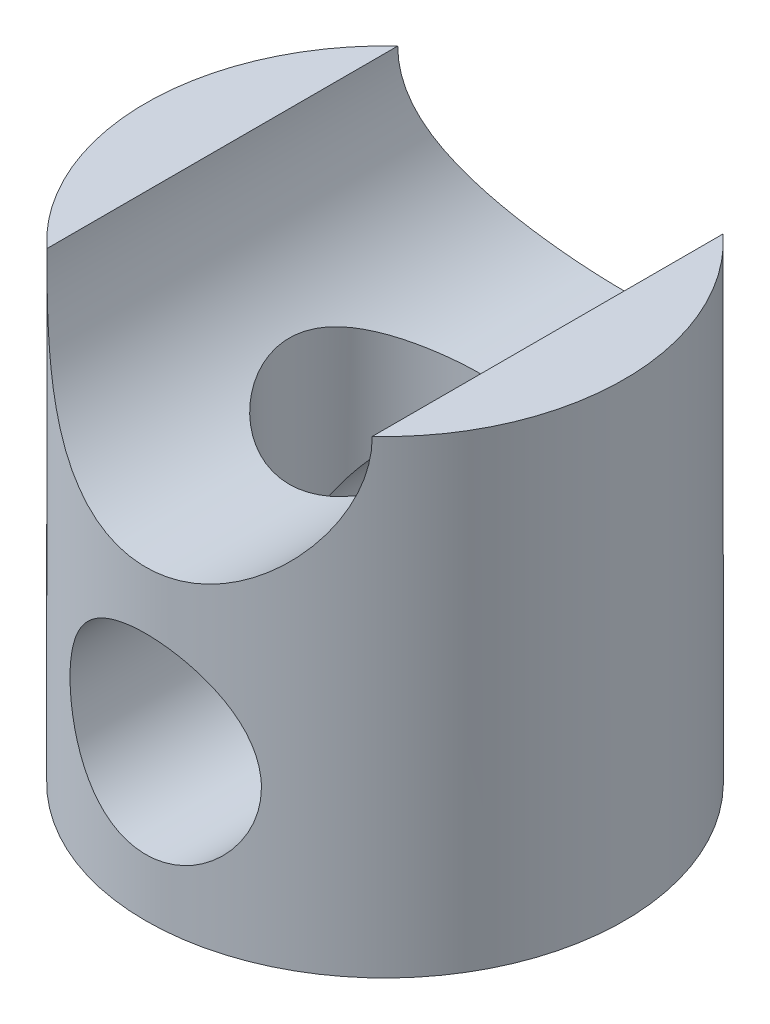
ISO-10303-21;
HEADER;
FILE_DESCRIPTION(('STEP AP214'),'2;1');
FILE_NAME('part.step','',(''),(''),'','','');
FILE_SCHEMA(('AUTOMOTIVE_DESIGN { 1 0 10303 214 1 1 1 1 }'));
ENDSEC;
DATA;
#1=APPLICATION_CONTEXT('core data for automotive mechanical design processes');
#2=APPLICATION_PROTOCOL_DEFINITION('international standard','automotive_design',2000,#1);
#3=PRODUCT_CONTEXT('',#1,'mechanical');
#4=PRODUCT('Part','Part','',(#3));
#5=PRODUCT_RELATED_PRODUCT_CATEGORY('part','',(#4));
#6=PRODUCT_DEFINITION_FORMATION('','',#4);
#7=PRODUCT_DEFINITION_CONTEXT('part definition',#1,'design');
#8=PRODUCT_DEFINITION('design','',#6,#7);
#9=PRODUCT_DEFINITION_SHAPE('','',#8);
#10=(LENGTH_UNIT() NAMED_UNIT(*) SI_UNIT(.MILLI.,.METRE.));
#11=(NAMED_UNIT(*) PLANE_ANGLE_UNIT() SI_UNIT($,.RADIAN.));
#12=(NAMED_UNIT(*) SI_UNIT($,.STERADIAN.) SOLID_ANGLE_UNIT());
#13=UNCERTAINTY_MEASURE_WITH_UNIT(LENGTH_MEASURE(1.E-05),#10,'distance_accuracy_value','');
#14=(GEOMETRIC_REPRESENTATION_CONTEXT(3) GLOBAL_UNCERTAINTY_ASSIGNED_CONTEXT((#13)) GLOBAL_UNIT_ASSIGNED_CONTEXT((#10,
#11,#12)) REPRESENTATION_CONTEXT('',''));
#15=CARTESIAN_POINT('',(0.,0.,0.));
#16=DIRECTION('',(0.,0.,1.));
#17=DIRECTION('',(1.,0.,0.));
#18=AXIS2_PLACEMENT_3D('',#15,#16,#17);
#19=CARTESIAN_POINT('',(0.,64.,-100.));
#20=DIRECTION('',(0.,0.,1.));
#21=DIRECTION('',(1.,0.,0.));
#22=AXIS2_PLACEMENT_3D('',#19,#20,#21);
#23=CYLINDRICAL_SURFACE('',#22,40.);
#24=CARTESIAN_POINT('',(40.,64.,91.6515138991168));
#25=CARTESIAN_POINT('',(39.9999916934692,62.9282266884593,91.6515221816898));
#26=CARTESIAN_POINT('',(39.9568648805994,61.8561255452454,91.6703771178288));
#27=CARTESIAN_POINT('',(39.7847783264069,59.7196749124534,91.7451902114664));
#28=CARTESIAN_POINT('',(39.6557660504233,58.6553305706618,91.8011710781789));
#29=CARTESIAN_POINT('',(39.3128963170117,56.5403588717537,91.9485237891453));
#30=CARTESIAN_POINT('',(39.0988461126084,55.4897683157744,92.039976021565));
#31=CARTESIAN_POINT('',(38.5881948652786,53.4124919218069,92.2552319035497));
#32=CARTESIAN_POINT('',(38.2916057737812,52.3858026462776,92.3790308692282));
#33=CARTESIAN_POINT('',(37.6199084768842,50.3665831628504,92.6545931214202));
#34=CARTESIAN_POINT('',(37.2451002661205,49.3739388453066,92.8062493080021));
#35=CARTESIAN_POINT('',(36.6260653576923,47.9123791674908,93.0514933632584));
#36=CARTESIAN_POINT('',(36.4102338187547,47.4297294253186,93.1362075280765));
#37=CARTESIAN_POINT('',(35.9599736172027,46.4740380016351,93.3109782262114));
#38=CARTESIAN_POINT('',(35.7255410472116,46.0009983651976,93.4010358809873));
#39=CARTESIAN_POINT('',(34.9952799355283,44.5978948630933,93.678180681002));
#40=CARTESIAN_POINT('',(34.4722258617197,43.6832283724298,93.8723446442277));
#41=CARTESIAN_POINT('',(33.3571565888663,41.9000900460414,94.2743398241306));
#42=CARTESIAN_POINT('',(32.7651374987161,41.0316208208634,94.482171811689));
#43=CARTESIAN_POINT('',(31.8119674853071,39.7450313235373,94.8056915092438));
#44=CARTESIAN_POINT('',(31.4743631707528,39.3085310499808,94.9183716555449));
#45=CARTESIAN_POINT('',(30.7816889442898,38.4502112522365,95.1452597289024));
#46=CARTESIAN_POINT('',(30.4266231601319,38.0283882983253,95.2594672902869));
#47=CARTESIAN_POINT('',(29.335808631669,36.7855682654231,95.6033021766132));
#48=CARTESIAN_POINT('',(28.5744052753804,35.9871695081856,95.8341545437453));
#49=CARTESIAN_POINT('',(26.9876506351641,34.4553987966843,96.2930375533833));
#50=CARTESIAN_POINT('',(26.1622779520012,33.7220487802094,96.5210672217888));
#51=CARTESIAN_POINT('',(24.4522595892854,32.3249965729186,96.9683862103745));
#52=CARTESIAN_POINT('',(23.56761301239,31.6612954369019,97.1876753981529));
#53=CARTESIAN_POINT('',(21.7079222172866,30.3832058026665,97.6202486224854));
#54=CARTESIAN_POINT('',(20.7306869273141,29.7718038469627,97.8329525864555));
#55=CARTESIAN_POINT('',(18.7236172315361,28.6339587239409,98.2368255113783));
#56=CARTESIAN_POINT('',(17.6937810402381,28.1075184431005,98.427993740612));
#57=CARTESIAN_POINT('',(15.5887811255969,27.1444846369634,98.7832408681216));
#58=CARTESIAN_POINT('',(14.513631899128,26.7078626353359,98.9473283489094));
#59=CARTESIAN_POINT('',(12.3255355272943,25.9286243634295,99.2436378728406));
#60=CARTESIAN_POINT('',(11.2125908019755,25.5860020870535,99.3758619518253));
#61=CARTESIAN_POINT('',(9.01220027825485,25.0126994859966,99.5989123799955));
#62=CARTESIAN_POINT('',(7.92612791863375,24.7774033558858,99.6914327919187));
#63=CARTESIAN_POINT('',(5.73579762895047,24.3977795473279,99.8414010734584));
#64=CARTESIAN_POINT('',(4.63154023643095,24.2534491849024,99.8988499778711));
#65=CARTESIAN_POINT('',(2.41389119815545,24.0573928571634,99.9770162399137));
#66=CARTESIAN_POINT('',(1.30050256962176,24.0056374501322,99.9977452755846));
#67=CARTESIAN_POINT('',(-0.926761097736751,23.9952355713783,100.00190551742));
#68=CARTESIAN_POINT('',(-2.04063611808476,24.036585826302,99.9853380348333));
#69=CARTESIAN_POINT('',(-4.19740332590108,24.2069676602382,99.9173650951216));
#70=CARTESIAN_POINT('',(-5.24076375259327,24.330936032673,99.8679718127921));
#71=CARTESIAN_POINT('',(-7.31254032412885,24.6601115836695,99.7376757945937));
#72=CARTESIAN_POINT('',(-8.3409571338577,24.8653151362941,99.6567744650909));
#73=CARTESIAN_POINT('',(-10.3759413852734,25.3550107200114,99.4654937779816));
#74=CARTESIAN_POINT('',(-11.3825080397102,25.6395056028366,99.3551133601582));
#75=CARTESIAN_POINT('',(-13.3673273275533,26.2852313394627,99.1075925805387));
#76=CARTESIAN_POINT('',(-14.34557915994,26.6464643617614,98.9704514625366));
#77=CARTESIAN_POINT('',(-16.2823173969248,27.4486494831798,98.6704657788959));
#78=CARTESIAN_POINT('',(-17.2402860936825,27.8907176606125,98.5072660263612));
#79=CARTESIAN_POINT('',(-19.1154397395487,28.847362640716,98.1606296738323));
#80=CARTESIAN_POINT('',(-20.0326245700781,29.3619396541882,97.9771930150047));
#81=CARTESIAN_POINT('',(-21.8215216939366,30.4601281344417,97.5943551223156));
#82=CARTESIAN_POINT('',(-22.6932214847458,31.0437584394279,97.3949495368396));
#83=CARTESIAN_POINT('',(-24.3864081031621,32.2761945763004,96.9848551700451));
#84=CARTESIAN_POINT('',(-25.2078928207,32.9250031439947,96.7741659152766));
#85=CARTESIAN_POINT('',(-26.8488767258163,34.328824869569,96.3322701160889));
#86=CARTESIAN_POINT('',(-27.664700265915,35.0880149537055,96.1006249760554));
#87=CARTESIAN_POINT('',(-28.8384896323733,36.2754349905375,95.7523280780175));
#88=CARTESIAN_POINT('',(-29.2214509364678,36.6793744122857,95.6360835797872));
#89=CARTESIAN_POINT('',(-29.9703526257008,37.5030597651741,95.4040441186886));
#90=CARTESIAN_POINT('',(-30.3362887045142,37.9228096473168,95.2882492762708));
#91=CARTESIAN_POINT('',(-31.4076819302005,39.2048788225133,94.9427229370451));
#92=CARTESIAN_POINT('',(-32.0867224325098,40.0900159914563,94.71485011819));
#93=CARTESIAN_POINT('',(-33.3696854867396,41.9158684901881,94.2704896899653));
#94=CARTESIAN_POINT('',(-33.9736098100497,42.8565825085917,94.0540018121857));
#95=CARTESIAN_POINT('',(-34.8279058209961,44.318840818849,93.7395996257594));
#96=CARTESIAN_POINT('',(-35.1075449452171,44.822089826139,93.6351585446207));
#97=CARTESIAN_POINT('',(-35.6452152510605,45.8409723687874,93.4317998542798));
#98=CARTESIAN_POINT('',(-35.9032515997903,46.3566029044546,93.3328809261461));
#99=CARTESIAN_POINT('',(-36.3972372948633,47.399575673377,93.1413513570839));
#100=CARTESIAN_POINT('',(-36.6331838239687,47.9269193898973,93.0487415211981));
#101=CARTESIAN_POINT('',(-37.0824053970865,48.9923485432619,92.8706278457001));
#102=CARTESIAN_POINT('',(-37.2956790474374,49.5304346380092,92.7851244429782));
#103=CARTESIAN_POINT('',(-37.9004288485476,51.1587780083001,92.5405165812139));
#104=CARTESIAN_POINT('',(-38.2572367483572,52.2639702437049,92.3931564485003));
#105=CARTESIAN_POINT('',(-38.8741136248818,54.5050432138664,92.1353096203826));
#106=CARTESIAN_POINT('',(-39.1341903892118,55.6409214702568,92.0248199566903));
#107=CARTESIAN_POINT('',(-39.5417392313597,57.8641421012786,91.8504048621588));
#108=CARTESIAN_POINT('',(-39.6951203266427,58.9502097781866,91.7840469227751));
#109=CARTESIAN_POINT('',(-39.9121856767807,61.13292020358,91.6898662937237));
#110=CARTESIAN_POINT('',(-39.975873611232,62.2295625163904,91.6620420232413));
#111=CARTESIAN_POINT('',(-40.0128011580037,64.4243658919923,91.6459280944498));
#112=CARTESIAN_POINT('',(-39.9860647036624,65.5225264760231,91.6576279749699));
#113=CARTESIAN_POINT('',(-39.8425131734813,67.7117981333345,91.720119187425));
#114=CARTESIAN_POINT('',(-39.7257003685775,68.8029093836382,91.7709095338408));
#115=CARTESIAN_POINT('',(-39.41257931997,70.9076229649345,91.9057978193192));
#116=CARTESIAN_POINT('',(-39.2211880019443,71.9220951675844,91.9878296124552));
#117=CARTESIAN_POINT('',(-38.7614336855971,73.9303756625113,92.182501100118));
#118=CARTESIAN_POINT('',(-38.4930742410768,74.9241849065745,92.2951393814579));
#119=CARTESIAN_POINT('',(-37.8817574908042,76.8851636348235,92.5477265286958));
#120=CARTESIAN_POINT('',(-37.5387882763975,77.8523288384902,92.687679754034));
#121=CARTESIAN_POINT('',(-36.7811067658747,79.7543123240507,92.9909490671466));
#122=CARTESIAN_POINT('',(-36.3663912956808,80.6891291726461,93.154266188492));
#123=CARTESIAN_POINT('',(-35.4499821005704,82.5587104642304,93.5069479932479));
#124=CARTESIAN_POINT('',(-34.9454447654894,83.4919377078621,93.6971000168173));
#125=CARTESIAN_POINT('',(-34.1356873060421,84.857495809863,93.9938159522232));
#126=CARTESIAN_POINT('',(-33.856926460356,85.3069913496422,94.0946416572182));
#127=CARTESIAN_POINT('',(-33.2820994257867,86.1941718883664,94.2994962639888));
#128=CARTESIAN_POINT('',(-32.9860296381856,86.6318544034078,94.4035258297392));
#129=CARTESIAN_POINT('',(-32.0725003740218,87.9263506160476,94.7194273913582));
#130=CARTESIAN_POINT('',(-31.4297461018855,88.7645706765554,94.9351029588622));
#131=CARTESIAN_POINT('',(-30.0806461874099,90.3868871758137,95.3711545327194));
#132=CARTESIAN_POINT('',(-29.3742980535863,91.1709814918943,95.5915307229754));
#133=CARTESIAN_POINT('',(-28.2427670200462,92.3313775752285,95.9297477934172));
#134=CARTESIAN_POINT('',(-27.8387681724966,92.7284492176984,96.0478358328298));
#135=CARTESIAN_POINT('',(-27.014223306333,93.5051263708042,96.282997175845));
#136=CARTESIAN_POINT('',(-26.593681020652,93.8847357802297,96.4000707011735));
#137=CARTESIAN_POINT('',(-25.3078864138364,94.9966893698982,96.7486385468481));
#138=CARTESIAN_POINT('',(-24.4184232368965,95.7022031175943,96.9774931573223));
#139=CARTESIAN_POINT('',(-22.5805653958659,97.0364643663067,97.4218254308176));
#140=CARTESIAN_POINT('',(-21.632166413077,97.6652062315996,97.6373021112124));
#141=CARTESIAN_POINT('',(-19.6821019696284,98.8412257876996,98.0490061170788));
#142=CARTESIAN_POINT('',(-18.6804377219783,99.3885053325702,98.2452338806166));
#143=CARTESIAN_POINT('',(-16.6304379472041,100.396883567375,98.6129436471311));
#144=CARTESIAN_POINT('',(-15.5821099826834,100.857996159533,98.7844296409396));
#145=CARTESIAN_POINT('',(-13.4458356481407,101.68982991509,99.0978039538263));
#146=CARTESIAN_POINT('',(-12.3578889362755,102.060550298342,99.2396920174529));
#147=CARTESIAN_POINT('',(-10.1509867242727,102.707610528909,99.4896478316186));
#148=CARTESIAN_POINT('',(-9.03204531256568,102.983992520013,99.5977306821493));
#149=CARTESIAN_POINT('',(-6.77164051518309,103.439495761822,99.7769003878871));
#150=CARTESIAN_POINT('',(-5.63017865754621,103.618623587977,99.847989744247));
#151=CARTESIAN_POINT('',(-3.40930815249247,103.869069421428,99.9476389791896));
#152=CARTESIAN_POINT('',(-2.33071374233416,103.946662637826,99.9786725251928));
#153=CARTESIAN_POINT('',(-0.170368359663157,104.014231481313,100.005688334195));
#154=CARTESIAN_POINT('',(0.911382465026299,104.004211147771,100.001672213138));
#155=CARTESIAN_POINT('',(3.069661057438,103.896673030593,99.9587020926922));
#156=CARTESIAN_POINT('',(4.1461895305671,103.799167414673,99.9197529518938));
#157=CARTESIAN_POINT('',(6.28609075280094,103.517713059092,99.8079805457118));
#158=CARTESIAN_POINT('',(7.34946355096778,103.333764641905,99.7351574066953));
#159=CARTESIAN_POINT('',(9.42285550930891,102.888293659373,99.5603276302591));
#160=CARTESIAN_POINT('',(10.4335092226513,102.629334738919,99.4592888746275));
#161=CARTESIAN_POINT('',(12.4286158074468,102.034367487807,99.2297224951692));
#162=CARTESIAN_POINT('',(13.4130694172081,101.69836133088,99.10119564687));
#163=CARTESIAN_POINT('',(15.3499169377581,100.952094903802,98.81972446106));
#164=CARTESIAN_POINT('',(16.3023068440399,100.541825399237,98.6667770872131));
#165=CARTESIAN_POINT('',(18.1695090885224,99.650237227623,98.3400601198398));
#166=CARTESIAN_POINT('',(19.0843199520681,99.1689157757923,98.1662897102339));
#167=CARTESIAN_POINT('',(20.910975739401,98.1158473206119,97.7938540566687));
#168=CARTESIAN_POINT('',(21.820904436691,97.5410450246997,97.5944281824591));
#169=CARTESIAN_POINT('',(23.5894882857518,96.3216624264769,97.1821007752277));
#170=CARTESIAN_POINT('',(24.4481421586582,95.6770803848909,96.9691989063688));
#171=CARTESIAN_POINT('',(26.1097727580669,94.3220908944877,96.5350574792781));
#172=CARTESIAN_POINT('',(26.9127417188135,93.6116742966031,96.3138167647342));
#173=CARTESIAN_POINT('',(28.4590433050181,92.1288264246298,95.8682984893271));
#174=CARTESIAN_POINT('',(29.2023476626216,91.3563660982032,95.6440195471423));
#175=CARTESIAN_POINT('',(30.6690462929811,89.7041711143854,95.1842234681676));
#176=CARTESIAN_POINT('',(31.3883480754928,88.8207547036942,94.9488718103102));
#177=CARTESIAN_POINT('',(32.749851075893,86.9944250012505,94.4879023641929));
#178=CARTESIAN_POINT('',(33.3920860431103,86.0515380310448,94.2622803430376));
#179=CARTESIAN_POINT('',(34.2944310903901,84.5965577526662,93.936118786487));
#180=CARTESIAN_POINT('',(34.5851464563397,84.1045893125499,93.8294042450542));
#181=CARTESIAN_POINT('',(35.1456026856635,83.1079421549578,93.6209161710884));
#182=CARTESIAN_POINT('',(35.4153470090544,82.6032655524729,93.519141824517));
#183=CARTESIAN_POINT('',(36.1922948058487,81.0712715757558,93.2224518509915));
#184=CARTESIAN_POINT('',(36.667387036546,80.0257097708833,93.0361057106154));
#185=CARTESIAN_POINT('',(37.4885359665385,77.9894472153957,92.7080753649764));
#186=CARTESIAN_POINT('',(37.8423511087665,77.0022581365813,92.5638826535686));
#187=CARTESIAN_POINT('',(38.4722270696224,74.9995159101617,92.3038677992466));
#188=CARTESIAN_POINT('',(38.7482812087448,73.983960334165,92.1880480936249));
#189=CARTESIAN_POINT('',(39.2193558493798,71.9338402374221,91.9886267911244));
#190=CARTESIAN_POINT('',(39.4145772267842,70.899329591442,91.9049453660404));
#191=CARTESIAN_POINT('',(39.7229130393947,68.8163707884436,91.7721017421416));
#192=CARTESIAN_POINT('',(39.8360751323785,67.7679310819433,91.7229195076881));
#193=CARTESIAN_POINT('',(39.9384212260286,66.2644983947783,91.6783688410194));
#194=CARTESIAN_POINT('',(39.9615053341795,65.8120029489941,91.6683063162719));
#195=CARTESIAN_POINT('',(39.9922970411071,64.9063579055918,91.6548768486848));
#196=CARTESIAN_POINT('',(40.0000035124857,64.4532082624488,91.6515103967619));
#197=CARTESIAN_POINT('',(40.,64.,91.6515138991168));
#198=B_SPLINE_CURVE_WITH_KNOTS('',3,(#24,#25,#26,#27,#28,#29,#30,#31,#32,#33,#34,#35,#36,#37,
#38,#39,#40,#41,#42,#43,#44,#45,#46,#47,#48,#49,#50,#51,#52,#53,#54,#55,#56,#57,#58,#59,#60,#61,
#62,#63,#64,#65,#66,#67,#68,#69,#70,#71,#72,#73,#74,#75,#76,#77,#78,#79,#80,#81,#82,#83,#84,#85,
#86,#87,#88,#89,#90,#91,#92,#93,#94,#95,#96,#97,#98,#99,#100,#101,#102,#103,#104,#105,#106,#107,
#108,#109,#110,#111,#112,#113,#114,#115,#116,#117,#118,#119,#120,#121,#122,#123,#124,#125,#126,
#127,#128,#129,#130,#131,#132,#133,#134,#135,#136,#137,#138,#139,#140,#141,#142,#143,#144,#145,
#146,#147,#148,#149,#150,#151,#152,#153,#154,#155,#156,#157,#158,#159,#160,#161,#162,#163,#164,
#165,#166,#167,#168,#169,#170,#171,#172,#173,#174,#175,#176,#177,#178,#179,#180,#181,#182,#183,
#184,#185,#186,#187,#188,#189,#190,#191,#192,#193,#194,#195,#196,#197),.UNSPECIFIED.,.T.,.F.,(4,
2,2,2,2,2,2,2,2,2,2,2,2,2,2,2,2,2,2,2,2,2,2,2,2,2,2,2,2,2,2,2,2,2,2,2,2,2,2,2,2,2,2,2,2,2,2,2,2,
2,2,2,2,2,2,2,2,2,2,2,2,2,2,2,2,2,2,2,2,2,2,2,2,2,2,2,2,2,2,2,2,2,2,2,2,2,4),(0.,
3.21486083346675,6.43168995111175,9.65585231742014,12.8795480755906,16.0910999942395,
17.6970881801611,19.3034146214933,22.5140350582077,25.7248367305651,27.4140524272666,
29.1028707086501,32.4803153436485,35.8588947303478,39.2375252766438,42.7497164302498,
46.2620268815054,49.77322205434,53.2841928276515,56.6252135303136,59.9661356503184,
63.3059950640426,66.6457370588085,69.797607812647,72.9493378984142,76.1011813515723,
79.2531138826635,82.4523972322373,85.6516898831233,88.8518573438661,92.0521591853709,
95.4626995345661,97.1681841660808,98.8740978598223,102.285932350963,105.697686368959,
107.452576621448,109.207045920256,110.961738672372,112.716539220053,116.223289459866,
119.729757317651,123.021989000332,126.314085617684,129.605310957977,132.896453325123,
135.999782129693,139.102967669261,142.206648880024,145.310467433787,148.540062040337,
150.155033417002,151.770341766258,155.001108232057,158.23200132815,159.96747266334,
161.702554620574,165.172529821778,168.642759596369,172.112910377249,175.582500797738,
179.052121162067,182.520189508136,185.988023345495,189.229446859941,192.470720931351,
195.711544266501,198.952355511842,202.093354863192,205.234265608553,208.375567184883,
211.516991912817,214.797189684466,218.077469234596,221.35820533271,224.640486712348,
228.126293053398,231.610567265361,233.354066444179,235.097277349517,238.582694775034,
241.754944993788,244.927467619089,248.09205825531,251.254809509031,252.614140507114,
253.973571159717),.UNSPECIFIED.);
#199=CARTESIAN_POINT('',(40.,64.,91.6515138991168));
#200=VERTEX_POINT('',#199);
#201=EDGE_CURVE('E86',#200,#200,#198,.T.);
#202=ORIENTED_EDGE('',*,*,#201,.F.);
#203=EDGE_LOOP('',(#202));
#204=FACE_BOUND('',#203,.T.);
#205=CARTESIAN_POINT('',(0.,64.,0.));
#206=DIRECTION('',(0.,-0.707106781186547,0.707106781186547));
#207=DIRECTION('',(0.,0.707106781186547,0.707106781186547));
#208=AXIS2_PLACEMENT_3D('',#205,#206,#207);
#209=ELLIPSE('',#208,56.5685424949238,40.);
#210=CARTESIAN_POINT('',(-40.,64.,0.));
#211=VERTEX_POINT('',#210);
#212=CARTESIAN_POINT('',(40.,64.,0.));
#213=VERTEX_POINT('',#212);
#214=EDGE_CURVE('E45',#211,#213,#209,.F.);
#215=ORIENTED_EDGE('',*,*,#214,.T.);
#216=CARTESIAN_POINT('',(0.,64.,0.));
#217=DIRECTION('',(0.,0.707106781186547,0.707106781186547));
#218=DIRECTION('',(0.,-0.707106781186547,0.707106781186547));
#219=AXIS2_PLACEMENT_3D('',#216,#217,#218);
#220=ELLIPSE('',#219,56.5685424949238,40.);
#221=EDGE_CURVE('E11',#213,#211,#220,.F.);
#222=ORIENTED_EDGE('',*,*,#221,.T.);
#223=EDGE_LOOP('',(#215,#222));
#224=FACE_BOUND('',#223,.T.);
#225=ADVANCED_FACE('F31',(#204,#224),#23,.F.);
#226=CARTESIAN_POINT('',(0.,196.,0.));
#227=DIRECTION('',(0.,1.,0.));
#228=DIRECTION('',(0.,0.,1.));
#229=AXIS2_PLACEMENT_3D('',#226,#227,#228);
#230=PLANE('',#229);
#231=DIRECTION('',(0.,0.,1.));
#232=VECTOR('',#231,1.);
#233=CARTESIAN_POINT('',(-68.,196.,-100.));
#234=LINE('',#233,#232);
#235=CARTESIAN_POINT('',(-68.,196.,-73.3212111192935));
#236=VERTEX_POINT('',#235);
#237=CARTESIAN_POINT('',(-68.,196.,73.3212111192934));
#238=VERTEX_POINT('',#237);
#239=EDGE_CURVE('E124',#236,#238,#234,.T.);
#240=ORIENTED_EDGE('',*,*,#239,.F.);
#241=CARTESIAN_POINT('',(0.,196.,0.));
#242=DIRECTION('',(0.,1.,0.));
#243=DIRECTION('',(0.,0.,1.));
#244=AXIS2_PLACEMENT_3D('',#241,#242,#243);
#245=CIRCLE('',#244,100.);
#246=EDGE_CURVE('E117',#236,#238,#245,.T.);
#247=ORIENTED_EDGE('',*,*,#246,.T.);
#248=EDGE_LOOP('',(#240,#247));
#249=FACE_BOUND('',#248,.T.);
#250=ADVANCED_FACE('F132',(#249),#230,.T.);
#251=CARTESIAN_POINT('',(0.,196.,0.));
#252=DIRECTION('',(0.,-1.,0.));
#253=DIRECTION('',(0.,0.,-1.));
#254=AXIS2_PLACEMENT_3D('',#251,#252,#253);
#255=CYLINDRICAL_SURFACE('',#254,100.);
#256=CARTESIAN_POINT('',(0.,104.,-100.));
#257=CARTESIAN_POINT('',(-1.07542430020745,103.999993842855,-99.9999951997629));
#258=CARTESIAN_POINT('',(-2.15126346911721,103.956570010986,-99.9826036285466));
#259=CARTESIAN_POINT('',(-4.29533079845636,103.783265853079,-99.9134729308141));
#260=CARTESIAN_POINT('',(-5.36355339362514,103.653327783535,-99.8617108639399));
#261=CARTESIAN_POINT('',(-7.48664015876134,103.3078812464,-99.725043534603));
#262=CARTESIAN_POINT('',(-8.54146541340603,103.092164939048,-99.6400577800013));
#263=CARTESIAN_POINT('',(-10.6273324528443,102.577373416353,-99.4392158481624));
#264=CARTESIAN_POINT('',(-11.6583781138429,102.278311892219,-99.3233647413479));
#265=CARTESIAN_POINT('',(-13.686643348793,101.600735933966,-99.0642102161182));
#266=CARTESIAN_POINT('',(-14.6839621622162,101.222483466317,-98.9209974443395));
#267=CARTESIAN_POINT('',(-16.6420920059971,100.389189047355,-98.6104641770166));
#268=CARTESIAN_POINT('',(-17.6029016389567,99.9341441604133,-98.4431427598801));
#269=CARTESIAN_POINT('',(-19.4819955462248,98.9510475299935,-98.0885605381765));
#270=CARTESIAN_POINT('',(-20.4002980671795,98.4230275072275,-97.9013084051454));
#271=CARTESIAN_POINT('',(-22.1898123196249,97.2975934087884,-97.5112871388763));
#272=CARTESIAN_POINT('',(-23.0610230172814,96.7001778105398,-97.3085176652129));
#273=CARTESIAN_POINT('',(-24.7882928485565,95.4125743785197,-96.8832544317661));
#274=CARTESIAN_POINT('',(-25.6420948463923,94.7195043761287,-96.660287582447));
#275=CARTESIAN_POINT('',(-26.8769780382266,93.6298774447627,-96.3213918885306));
#276=CARTESIAN_POINT('',(-27.2809905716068,93.2583091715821,-96.2076792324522));
#277=CARTESIAN_POINT('',(-28.0733751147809,92.4988912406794,-95.9794540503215));
#278=CARTESIAN_POINT('',(-28.4617433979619,92.1110377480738,-95.8649413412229));
#279=CARTESIAN_POINT('',(-29.6026355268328,90.9237611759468,-95.5212794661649));
#280=CARTESIAN_POINT('',(-30.330820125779,90.1007336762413,-95.2920416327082));
#281=CARTESIAN_POINT('',(-31.7177268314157,88.3965714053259,-94.839433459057));
#282=CARTESIAN_POINT('',(-32.3764490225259,87.5154367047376,-94.6160631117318));
#283=CARTESIAN_POINT('',(-33.323161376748,86.1336269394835,-94.2851281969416));
#284=CARTESIAN_POINT('',(-33.6379805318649,85.6521915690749,-94.1731972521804));
#285=CARTESIAN_POINT('',(-34.2468853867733,84.6756359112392,-93.9534754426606));
#286=CARTESIAN_POINT('',(-34.5409759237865,84.1805188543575,-93.84568361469));
#287=CARTESIAN_POINT('',(-35.3914521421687,82.6754582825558,-93.5297341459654));
#288=CARTESIAN_POINT('',(-35.916092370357,81.6457325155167,-93.3289848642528));
#289=CARTESIAN_POINT('',(-36.8755784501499,79.5412025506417,-92.9540596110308));
#290=CARTESIAN_POINT('',(-37.3104578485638,78.4664153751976,-92.7798737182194));
#291=CARTESIAN_POINT('',(-38.0864416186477,76.2788187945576,-92.4640399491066));
#292=CARTESIAN_POINT('',(-38.4275523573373,75.1660119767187,-92.3223898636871));
#293=CARTESIAN_POINT('',(-38.9989418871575,72.9620968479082,-92.0824316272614));
#294=CARTESIAN_POINT('',(-39.2335431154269,71.8722908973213,-91.9824501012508));
#295=CARTESIAN_POINT('',(-39.6112076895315,69.674120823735,-91.8204477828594));
#296=CARTESIAN_POINT('',(-39.7542736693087,68.5657572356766,-91.7584258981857));
#297=CARTESIAN_POINT('',(-39.9471189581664,66.3398935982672,-91.6746354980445));
#298=CARTESIAN_POINT('',(-39.9969377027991,65.2223976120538,-91.6528499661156));
#299=CARTESIAN_POINT('',(-40.0027878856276,62.9871394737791,-91.650297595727));
#300=CARTESIAN_POINT('',(-39.958823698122,61.8693773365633,-91.6695288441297));
#301=CARTESIAN_POINT('',(-39.7839956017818,59.7205686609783,-91.7455274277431));
#302=CARTESIAN_POINT('',(-39.6594023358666,58.6889083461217,-91.7995850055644));
#303=CARTESIAN_POINT('',(-39.3308532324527,56.6406723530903,-91.940828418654));
#304=CARTESIAN_POINT('',(-39.1269016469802,55.6240958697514,-92.0280124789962));
#305=CARTESIAN_POINT('',(-38.6415966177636,53.6126240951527,-92.2328370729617));
#306=CARTESIAN_POINT('',(-38.3602335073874,52.6177315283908,-92.3504814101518));
#307=CARTESIAN_POINT('',(-37.7226664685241,50.6559195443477,-92.61273745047));
#308=CARTESIAN_POINT('',(-37.3664598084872,49.6890011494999,-92.7573501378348));
#309=CARTESIAN_POINT('',(-36.5740551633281,47.7692131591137,-93.072680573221));
#310=CARTESIAN_POINT('',(-36.1363766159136,46.8170300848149,-93.2438697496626));
#311=CARTESIAN_POINT('',(-35.4263083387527,45.4190940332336,-93.5149226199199));
#312=CARTESIAN_POINT('',(-35.1806806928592,44.9581502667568,-93.6076565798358));
#313=CARTESIAN_POINT('',(-34.6719099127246,44.0467784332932,-93.7972942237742));
#314=CARTESIAN_POINT('',(-34.4087632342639,43.5963525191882,-93.8941987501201));
#315=CARTESIAN_POINT('',(-33.5936725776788,42.2617410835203,-94.1902298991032));
#316=CARTESIAN_POINT('',(-33.0160810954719,41.3942279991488,-94.3946728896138));
#317=CARTESIAN_POINT('',(-31.7961420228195,39.7082695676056,-94.8125567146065));
#318=CARTESIAN_POINT('',(-31.1537910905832,38.8898267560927,-95.0259980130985));
#319=CARTESIAN_POINT('',(-30.1183942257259,37.6713865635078,-95.3573661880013));
#320=CARTESIAN_POINT('',(-29.7469817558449,37.2524711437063,-95.4739496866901));
#321=CARTESIAN_POINT('',(-28.987047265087,36.4307373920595,-95.7074140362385));
#322=CARTESIAN_POINT('',(-28.5985290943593,36.027915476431,-95.8242948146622));
#323=CARTESIAN_POINT('',(-27.4079203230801,34.8442418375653,-96.1742684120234));
#324=CARTESIAN_POINT('',(-26.580739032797,34.0881393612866,-96.4067042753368));
#325=CARTESIAN_POINT('',(-24.8644635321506,32.6469348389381,-96.8635498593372));
#326=CARTESIAN_POINT('',(-23.9753566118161,31.9618474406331,-97.0879579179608));
#327=CARTESIAN_POINT('',(-22.1403577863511,30.6673572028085,-97.5227840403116));
#328=CARTESIAN_POINT('',(-21.1944661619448,30.0579539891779,-97.7332021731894));
#329=CARTESIAN_POINT('',(-19.2322330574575,28.908123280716,-98.1383944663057));
#330=CARTESIAN_POINT('',(-18.2148658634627,28.369305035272,-98.3327751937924));
#331=CARTESIAN_POINT('',(-16.1335914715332,27.3798577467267,-98.6956072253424));
#332=CARTESIAN_POINT('',(-15.0696832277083,26.9292306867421,-98.8640579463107));
#333=CARTESIAN_POINT('',(-12.9033452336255,26.120721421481,-99.1700544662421));
#334=CARTESIAN_POINT('',(-11.8009315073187,25.762801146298,-99.3076129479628));
#335=CARTESIAN_POINT('',(-9.56565219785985,25.1433009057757,-99.5477845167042));
#336=CARTESIAN_POINT('',(-8.43278872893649,24.8817142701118,-99.6504000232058));
#337=CARTESIAN_POINT('',(-6.21362969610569,24.4704176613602,-99.8125965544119));
#338=CARTESIAN_POINT('',(-5.12854925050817,24.3149998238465,-99.874366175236));
#339=CARTESIAN_POINT('',(-2.94787308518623,24.0937230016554,-99.9624957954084));
#340=CARTESIAN_POINT('',(-1.85227778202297,24.0278604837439,-99.9888571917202));
#341=CARTESIAN_POINT('',(0.340639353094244,23.9864223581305,-100.00543009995));
#342=CARTESIAN_POINT('',(1.43796073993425,24.0108263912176,-99.9956497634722));
#343=CARTESIAN_POINT('',(3.6259707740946,24.1496057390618,-99.9402314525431));
#344=CARTESIAN_POINT('',(4.71665954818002,24.263979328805,-99.894594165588));
#345=CARTESIAN_POINT('',(6.83418930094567,24.5742855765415,-99.771577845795));
#346=CARTESIAN_POINT('',(7.86169424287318,24.766315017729,-99.6957201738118));
#347=CARTESIAN_POINT('',(9.8960069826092,25.2294283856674,-99.5143800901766));
#348=CARTESIAN_POINT('',(10.9028155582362,25.5005093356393,-99.408898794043));
#349=CARTESIAN_POINT('',(12.8893652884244,26.1193091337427,-99.1708890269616));
#350=CARTESIAN_POINT('',(13.8691043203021,26.4670339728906,-99.0383584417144));
#351=CARTESIAN_POINT('',(15.7955553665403,27.2362099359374,-98.7494267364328));
#352=CARTESIAN_POINT('',(16.7422662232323,27.6576636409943,-98.5930247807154));
#353=CARTESIAN_POINT('',(18.6256679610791,28.5850354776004,-98.2549116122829));
#354=CARTESIAN_POINT('',(19.561168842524,29.0931409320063,-98.0725730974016));
#355=CARTESIAN_POINT('',(21.386183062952,30.1804858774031,-97.6908411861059));
#356=CARTESIAN_POINT('',(22.2756957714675,30.759726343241,-97.4914475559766));
#357=CARTESIAN_POINT('',(24.0043329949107,31.9857034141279,-97.0802845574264));
#358=CARTESIAN_POINT('',(24.8434404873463,32.6324626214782,-96.8685110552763));
#359=CARTESIAN_POINT('',(26.4666792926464,33.9894337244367,-96.4376492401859));
#360=CARTESIAN_POINT('',(27.2508084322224,34.699648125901,-96.2185606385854));
#361=CARTESIAN_POINT('',(28.8099872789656,36.228537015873,-95.7637038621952));
#362=CARTESIAN_POINT('',(29.5810132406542,37.0512773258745,-95.5277901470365));
#363=CARTESIAN_POINT('',(31.0514333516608,38.7595818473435,-95.0600017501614));
#364=CARTESIAN_POINT('',(31.7508242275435,39.6451489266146,-94.8281272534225));
#365=CARTESIAN_POINT('',(33.0735848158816,41.4741941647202,-94.374927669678));
#366=CARTESIAN_POINT('',(33.6969402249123,42.4176831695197,-94.1536045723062));
#367=CARTESIAN_POINT('',(34.8630208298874,44.3569394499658,-93.7280915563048));
#368=CARTESIAN_POINT('',(35.4057469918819,45.3527060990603,-93.5239014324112));
#369=CARTESIAN_POINT('',(36.4111072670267,47.4004562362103,-93.1371268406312));
#370=CARTESIAN_POINT('',(36.8729056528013,48.4528944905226,-92.954773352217));
#371=CARTESIAN_POINT('',(37.7055237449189,50.5978763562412,-92.6201653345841));
#372=CARTESIAN_POINT('',(38.0763422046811,51.6904205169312,-92.4679112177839));
#373=CARTESIAN_POINT('',(38.7228722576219,53.9068863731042,-92.1990340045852));
#374=CARTESIAN_POINT('',(38.9986425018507,55.030788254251,-92.0823889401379));
#375=CARTESIAN_POINT('',(39.4521366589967,57.3015619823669,-91.8890089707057));
#376=CARTESIAN_POINT('',(39.6298687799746,58.4484318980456,-91.8122707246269));
#377=CARTESIAN_POINT('',(39.8758776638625,60.6721969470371,-91.7056750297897));
#378=CARTESIAN_POINT('',(39.951114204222,61.7481844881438,-91.672839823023));
#379=CARTESIAN_POINT('',(40.0144029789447,63.903185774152,-91.6452336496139));
#380=CARTESIAN_POINT('',(40.0024595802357,64.9821993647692,-91.6504607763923));
#381=CARTESIAN_POINT('',(39.8915376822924,67.1347414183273,-91.6987939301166));
#382=CARTESIAN_POINT('',(39.7925694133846,68.208270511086,-91.7418955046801));
#383=CARTESIAN_POINT('',(39.5087314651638,70.3417853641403,-91.8644869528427));
#384=CARTESIAN_POINT('',(39.3238621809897,71.401771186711,-91.9439766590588));
#385=CARTESIAN_POINT('',(38.8792222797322,73.4588153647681,-92.1328488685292));
#386=CARTESIAN_POINT('',(38.6227121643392,74.4567023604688,-92.2409211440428));
#387=CARTESIAN_POINT('',(38.0346845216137,76.4265564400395,-92.4849393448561));
#388=CARTESIAN_POINT('',(37.7031696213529,77.3985244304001,-92.6208842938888));
#389=CARTESIAN_POINT('',(36.9678166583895,79.3111221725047,-92.9168310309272));
#390=CARTESIAN_POINT('',(36.5639637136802,80.2517454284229,-93.0768377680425));
#391=CARTESIAN_POINT('',(35.6870199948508,82.0964037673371,-93.4165812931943));
#392=CARTESIAN_POINT('',(35.2139258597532,83.0004370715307,-93.5963190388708));
#393=CARTESIAN_POINT('',(34.172577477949,84.81810782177,-93.9817022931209));
#394=CARTESIAN_POINT('',(33.6004258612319,85.7293319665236,-94.1882419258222));
#395=CARTESIAN_POINT('',(32.6898241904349,87.0578372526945,-94.5065013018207));
#396=CARTESIAN_POINT('',(32.3775412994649,87.4943084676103,-94.6140026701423));
#397=CARTESIAN_POINT('',(31.7358723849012,88.35409992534,-94.8311613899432));
#398=CARTESIAN_POINT('',(31.4064826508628,88.7774172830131,-94.9408192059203));
#399=CARTESIAN_POINT('',(30.3934040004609,90.0267288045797,-95.2719565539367));
#400=CARTESIAN_POINT('',(29.6847747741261,90.8321274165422,-95.4956108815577));
#401=CARTESIAN_POINT('',(28.2051458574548,92.3834237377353,-95.9430400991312));
#402=CARTESIAN_POINT('',(27.4341447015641,93.1293200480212,-96.1668149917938));
#403=CARTESIAN_POINT('',(26.2080484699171,94.2235745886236,-96.5056151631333));
#404=CARTESIAN_POINT('',(25.7737168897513,94.5948041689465,-96.6225877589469));
#405=CARTESIAN_POINT('',(24.889287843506,95.3185219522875,-96.8541807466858));
#406=CARTESIAN_POINT('',(24.439193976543,95.6710143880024,-96.9688016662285));
#407=CARTESIAN_POINT('',(23.0659652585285,96.6996811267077,-97.3080147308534));
#408=CARTESIAN_POINT('',(22.1198399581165,97.3470835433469,-97.5279692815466));
#409=CARTESIAN_POINT('',(20.172065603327,98.560167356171,-97.9493816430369));
#410=CARTESIAN_POINT('',(19.1703869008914,99.125804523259,-98.1508294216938));
#411=CARTESIAN_POINT('',(17.1183458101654,100.170253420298,-98.5294387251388));
#412=CARTESIAN_POINT('',(16.0679875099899,100.649072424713,-98.7066022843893));
#413=CARTESIAN_POINT('',(13.9458173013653,101.507329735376,-99.028503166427));
#414=CARTESIAN_POINT('',(12.8747696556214,101.888453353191,-99.1737831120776));
#415=CARTESIAN_POINT('',(10.7002595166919,102.559031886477,-99.4319015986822));
#416=CARTESIAN_POINT('',(9.59679144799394,102.848470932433,-99.5447345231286));
#417=CARTESIAN_POINT('',(7.36943167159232,103.331752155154,-99.7343343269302));
#418=CARTESIAN_POINT('',(6.24560717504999,103.525864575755,-99.8112031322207));
#419=CARTESIAN_POINT('',(3.98412144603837,103.817393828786,-99.9270071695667));
#420=CARTESIAN_POINT('',(2.84647135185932,103.914883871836,-99.9659711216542));
#421=CARTESIAN_POINT('',(1.42260281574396,103.975709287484,-99.9902862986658));
#422=CARTESIAN_POINT('',(1.13817882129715,103.984816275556,-99.9939273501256));
#423=CARTESIAN_POINT('',(0.569179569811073,103.996962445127,-99.9987848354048));
#424=CARTESIAN_POINT('',(0.284604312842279,104.00000162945,-100.000001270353));
#425=CARTESIAN_POINT('',(0.,104.,-100.));
#426=B_SPLINE_CURVE_WITH_KNOTS('',3,(#256,#257,#258,#259,#260,#261,#262,#263,#264,#265,#266,
#267,#268,#269,#270,#271,#272,#273,#274,#275,#276,#277,#278,#279,#280,#281,#282,#283,#284,#285,
#286,#287,#288,#289,#290,#291,#292,#293,#294,#295,#296,#297,#298,#299,#300,#301,#302,#303,#304,
#305,#306,#307,#308,#309,#310,#311,#312,#313,#314,#315,#316,#317,#318,#319,#320,#321,#322,#323,
#324,#325,#326,#327,#328,#329,#330,#331,#332,#333,#334,#335,#336,#337,#338,#339,#340,#341,#342,
#343,#344,#345,#346,#347,#348,#349,#350,#351,#352,#353,#354,#355,#356,#357,#358,#359,#360,#361,
#362,#363,#364,#365,#366,#367,#368,#369,#370,#371,#372,#373,#374,#375,#376,#377,#378,#379,#380,
#381,#382,#383,#384,#385,#386,#387,#388,#389,#390,#391,#392,#393,#394,#395,#396,#397,#398,#399,
#400,#401,#402,#403,#404,#405,#406,#407,#408,#409,#410,#411,#412,#413,#414,#415,#416,#417,#418,
#419,#420,#421,#422,#423,#424,#425),.UNSPECIFIED.,.T.,.F.,(4,2,2,2,2,2,2,2,2,2,2,2,2,2,2,2,2,2,
2,2,2,2,2,2,2,2,2,2,2,2,2,2,2,2,2,2,2,2,2,2,2,2,2,2,2,2,2,2,2,2,2,2,2,2,2,2,2,2,2,2,2,2,2,2,2,2,
2,2,2,2,2,2,2,2,2,2,2,2,2,2,2,2,2,2,4),(0.,3.2259803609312,6.45411604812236,9.69012160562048,
12.9255958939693,16.1505316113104,19.3755906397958,22.5992521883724,25.8229844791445,
29.1851492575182,30.866420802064,32.5480905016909,35.911945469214,39.2757963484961,
41.0333723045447,42.790536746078,46.3045963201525,49.817340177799,53.3298454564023,
56.6831577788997,60.0363736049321,63.388170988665,66.7398120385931,69.8578382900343,
72.9756975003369,76.0939462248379,79.2123087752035,82.3941420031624,83.9852121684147,
85.5766052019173,88.7594121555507,91.9423834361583,93.6575409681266,95.3723144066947,
98.8016893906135,102.231770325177,105.661834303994,109.159983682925,112.658211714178,
116.155000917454,119.651547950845,122.941033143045,126.230388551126,129.519002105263,
132.807552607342,135.948066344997,139.088461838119,142.229102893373,145.369853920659,
148.606569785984,151.843330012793,155.081177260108,158.319152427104,161.771087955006,
165.22318115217,168.675922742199,172.128622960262,175.615110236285,179.101645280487,
182.586025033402,186.070113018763,189.303331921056,192.536388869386,195.76906580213,
199.001727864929,202.106213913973,205.210591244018,208.315607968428,211.42077546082,
214.703717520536,216.345382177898,217.987404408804,221.271282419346,224.55523761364,
226.304410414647,228.053186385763,231.550560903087,235.049820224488,238.54878620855,
241.982564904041,245.416937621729,248.841517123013,252.263499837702,253.117235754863,
253.970971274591),.UNSPECIFIED.);
#427=CARTESIAN_POINT('',(0.,104.,-100.));
#428=VERTEX_POINT('',#427);
#429=EDGE_CURVE('E76',#428,#428,#426,.T.);
#430=ORIENTED_EDGE('',*,*,#429,.T.);
#431=EDGE_LOOP('',(#430));
#432=FACE_BOUND('',#431,.T.);
#433=ORIENTED_EDGE('',*,*,#201,.T.);
#434=EDGE_LOOP('',(#433));
#435=FACE_BOUND('',#434,.T.);
#436=CARTESIAN_POINT('',(68.,196.,73.3212111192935));
#437=VERTEX_POINT('',#436);
#438=CARTESIAN_POINT('',(68.,196.,-73.3212111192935));
#439=VERTEX_POINT('',#438);
#440=EDGE_CURVE('E120',#437,#439,#245,.T.);
#441=ORIENTED_EDGE('',*,*,#440,.F.);
#442=CARTESIAN_POINT('',(68.,196.,73.3212111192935));
#443=CARTESIAN_POINT('',(68.0000314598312,195.169495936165,73.321144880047));
#444=CARTESIAN_POINT('',(67.9847864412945,194.339011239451,73.3353194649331));
#445=CARTESIAN_POINT('',(67.923975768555,192.680190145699,73.3916663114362));
#446=CARTESIAN_POINT('',(67.8784133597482,191.851853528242,73.4338355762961));
#447=CARTESIAN_POINT('',(67.7572851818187,190.200419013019,73.5456095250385));
#448=CARTESIAN_POINT('',(67.6817616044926,189.377315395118,73.6151756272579));
#449=CARTESIAN_POINT('',(67.5011430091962,187.737043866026,73.7808294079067));
#450=CARTESIAN_POINT('',(67.3960474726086,186.919876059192,73.8769175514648));
#451=CARTESIAN_POINT('',(67.1580766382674,185.301656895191,74.0933081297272));
#452=CARTESIAN_POINT('',(67.0255014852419,184.500526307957,74.2133484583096));
#453=CARTESIAN_POINT('',(66.7325670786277,182.907216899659,74.476863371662));
#454=CARTESIAN_POINT('',(66.5722044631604,182.115039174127,74.6203407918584));
#455=CARTESIAN_POINT('',(66.0503997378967,179.753695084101,75.08370006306));
#456=CARTESIAN_POINT('',(65.6482392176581,178.199707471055,75.4365103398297));
#457=CARTESIAN_POINT('',(64.7440921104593,175.150066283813,76.2138769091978));
#458=CARTESIAN_POINT('',(64.2426768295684,173.654134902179,76.6380206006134));
#459=CARTESIAN_POINT('',(63.1443232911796,170.716544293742,77.5454811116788));
#460=CARTESIAN_POINT('',(62.5473904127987,169.274882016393,78.0287945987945));
#461=CARTESIAN_POINT('',(61.261256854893,166.445291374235,79.0425868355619));
#462=CARTESIAN_POINT('',(60.5718010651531,165.057525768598,79.5731945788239));
#463=CARTESIAN_POINT('',(59.1061779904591,162.342309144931,80.6678155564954));
#464=CARTESIAN_POINT('',(58.3300040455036,161.014862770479,81.2318313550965));
#465=CARTESIAN_POINT('',(56.5619776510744,158.212242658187,82.4747922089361));
#466=CARTESIAN_POINT('',(55.5555513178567,156.747943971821,83.1575611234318));
#467=CARTESIAN_POINT('',(53.4346288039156,153.906247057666,84.5360303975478));
#468=CARTESIAN_POINT('',(52.3201250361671,152.52885494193,85.2317316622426));
#469=CARTESIAN_POINT('',(49.9860176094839,149.863928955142,86.6212670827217));
#470=CARTESIAN_POINT('',(48.7663657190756,148.576436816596,87.3151002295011));
#471=CARTESIAN_POINT('',(46.225220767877,146.096287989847,88.6866000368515));
#472=CARTESIAN_POINT('',(44.9037212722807,144.903637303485,89.3642656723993));
#473=CARTESIAN_POINT('',(42.7424247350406,143.102505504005,90.4093881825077));
#474=CARTESIAN_POINT('',(41.9352903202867,142.460299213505,90.7868224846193));
#475=CARTESIAN_POINT('',(40.2890132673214,141.210739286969,91.5292873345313));
#476=CARTESIAN_POINT('',(39.4498735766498,140.603382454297,91.8943190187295));
#477=CARTESIAN_POINT('',(37.7401207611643,139.424724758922,92.6096234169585));
#478=CARTESIAN_POINT('',(36.8694979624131,138.853435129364,92.9598915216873));
#479=CARTESIAN_POINT('',(35.0981028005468,137.748712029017,93.6430678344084));
#480=CARTESIAN_POINT('',(34.1973345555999,137.215273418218,93.9759783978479));
#481=CARTESIAN_POINT('',(32.3678385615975,136.188446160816,94.6216825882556));
#482=CARTESIAN_POINT('',(31.4391471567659,135.695008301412,94.9345008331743));
#483=CARTESIAN_POINT('',(29.5542424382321,134.749216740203,95.5380862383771));
#484=CARTESIAN_POINT('',(28.5980329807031,134.296857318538,95.8288564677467));
#485=CARTESIAN_POINT('',(26.6598232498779,133.435007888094,96.3860475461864));
#486=CARTESIAN_POINT('',(25.6778296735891,133.025506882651,96.6524746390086));
#487=CARTESIAN_POINT('',(23.6898837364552,132.251058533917,97.1588482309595));
#488=CARTESIAN_POINT('',(22.6839334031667,131.88610743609,97.398796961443));
#489=CARTESIAN_POINT('',(20.1555142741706,131.036191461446,97.9599422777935));
#490=CARTESIAN_POINT('',(18.6196760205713,130.579128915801,98.2639315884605));
#491=CARTESIAN_POINT('',(15.508432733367,129.772581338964,98.8027378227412));
#492=CARTESIAN_POINT('',(13.9330344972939,129.423077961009,99.0375665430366));
#493=CARTESIAN_POINT('',(10.7532516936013,128.836175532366,99.4330541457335));
#494=CARTESIAN_POINT('',(9.14888608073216,128.59870574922,99.5937598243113));
#495=CARTESIAN_POINT('',(5.92136013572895,128.238845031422,99.8376511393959));
#496=CARTESIAN_POINT('',(4.29819918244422,128.116457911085,99.9208342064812));
#497=CARTESIAN_POINT('',(1.04234539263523,127.988440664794,100.007849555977));
#498=CARTESIAN_POINT('',(-0.590359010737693,127.983010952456,100.011545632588));
#499=CARTESIAN_POINT('',(-3.85013690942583,128.089501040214,99.9391532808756));
#500=CARTESIAN_POINT('',(-5.47721042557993,128.201420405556,99.8630651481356));
#501=CARTESIAN_POINT('',(-8.71400630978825,128.541012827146,99.632822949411));
#502=CARTESIAN_POINT('',(-10.3237243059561,128.768714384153,99.4786496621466));
#503=CARTESIAN_POINT('',(-13.5140781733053,129.336703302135,99.0956668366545));
#504=CARTESIAN_POINT('',(-15.0947139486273,129.676991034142,98.8668570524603));
#505=CARTESIAN_POINT('',(-18.1875834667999,130.45834512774,98.3444244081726));
#506=CARTESIAN_POINT('',(-19.7005433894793,130.897410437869,98.052091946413));
#507=CARTESIAN_POINT('',(-22.6804684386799,131.874690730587,97.4059594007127));
#508=CARTESIAN_POINT('',(-24.1474344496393,132.412903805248,97.0521604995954));
#509=CARTESIAN_POINT('',(-27.0286748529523,133.583104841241,96.2895210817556));
#510=CARTESIAN_POINT('',(-28.4429466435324,134.215097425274,95.8806778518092));
#511=CARTESIAN_POINT('',(-31.2133255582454,135.567353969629,95.0149197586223));
#512=CARTESIAN_POINT('',(-32.5694292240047,136.287623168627,94.5580020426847));
#513=CARTESIAN_POINT('',(-35.3685104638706,137.896987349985,93.5495774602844));
#514=CARTESIAN_POINT('',(-36.804060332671,138.7959604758,92.9932136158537));
#515=CARTESIAN_POINT('',(-39.5933218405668,140.6898626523,91.8403331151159));
#516=CARTESIAN_POINT('',(-40.9470282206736,141.68479785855,91.243813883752));
#517=CARTESIAN_POINT('',(-43.5705235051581,143.765760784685,90.0205881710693));
#518=CARTESIAN_POINT('',(-44.8402237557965,144.851882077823,89.3938509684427));
#519=CARTESIAN_POINT('',(-47.2914070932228,147.109312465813,88.1216767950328));
#520=CARTESIAN_POINT('',(-48.4728859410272,148.280625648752,87.4762389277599));
#521=CARTESIAN_POINT('',(-50.9378897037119,150.910015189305,86.0678380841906));
#522=CARTESIAN_POINT('',(-52.204741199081,152.38303615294,85.3035070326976));
#523=CARTESIAN_POINT('',(-54.610222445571,155.435234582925,83.7839364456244));
#524=CARTESIAN_POINT('',(-55.7488253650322,157.014434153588,83.028698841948));
#525=CARTESIAN_POINT('',(-57.8920448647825,160.274438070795,81.5487984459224));
#526=CARTESIAN_POINT('',(-58.8966889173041,161.955221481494,80.8241294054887));
#527=CARTESIAN_POINT('',(-60.7650358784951,165.414509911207,79.42901914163));
#528=CARTESIAN_POINT('',(-61.6287886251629,167.192980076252,78.7585587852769));
#529=CARTESIAN_POINT('',(-63.0132472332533,170.395624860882,77.6525132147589));
#530=CARTESIAN_POINT('',(-63.5661676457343,171.799944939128,77.1996106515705));
#531=CARTESIAN_POINT('',(-64.5819007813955,174.658068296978,76.3519199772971));
#532=CARTESIAN_POINT('',(-65.0447147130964,176.111870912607,75.9571310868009));
#533=CARTESIAN_POINT('',(-65.8737805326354,179.059503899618,75.2392564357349));
#534=CARTESIAN_POINT('',(-66.2403193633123,180.553200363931,74.9159580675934));
#535=CARTESIAN_POINT('',(-66.7150186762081,182.820357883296,74.4926224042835));
#536=CARTESIAN_POINT('',(-66.8607258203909,183.58045672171,74.3617863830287));
#537=CARTESIAN_POINT('',(-67.1265684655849,185.108495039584,74.1218994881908));
#538=CARTESIAN_POINT('',(-67.2467068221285,185.876433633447,74.0128461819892));
#539=CARTESIAN_POINT('',(-67.4606781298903,187.417405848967,73.8178692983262));
#540=CARTESIAN_POINT('',(-67.5545595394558,188.190427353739,73.7319031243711));
#541=CARTESIAN_POINT('',(-67.7158536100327,189.741334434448,73.5837964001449));
#542=CARTESIAN_POINT('',(-67.7832721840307,190.519218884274,73.5216505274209));
#543=CARTESIAN_POINT('',(-67.8914270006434,192.079929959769,73.4217943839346));
#544=CARTESIAN_POINT('',(-67.9321113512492,192.862763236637,73.3841316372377));
#545=CARTESIAN_POINT('',(-67.9864143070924,194.430392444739,73.33380994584));
#546=CARTESIAN_POINT('',(-68.0000251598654,195.215188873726,73.3211581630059));
#547=CARTESIAN_POINT('',(-68.,196.,73.3212111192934));
#548=B_SPLINE_CURVE_WITH_KNOTS('',3,(#442,#443,#444,#445,#446,#447,#448,#449,#450,#451,#452,
#453,#454,#455,#456,#457,#458,#459,#460,#461,#462,#463,#464,#465,#466,#467,#468,#469,#470,#471,
#472,#473,#474,#475,#476,#477,#478,#479,#480,#481,#482,#483,#484,#485,#486,#487,#488,#489,#490,
#491,#492,#493,#494,#495,#496,#497,#498,#499,#500,#501,#502,#503,#504,#505,#506,#507,#508,#509,
#510,#511,#512,#513,#514,#515,#516,#517,#518,#519,#520,#521,#522,#523,#524,#525,#526,#527,#528,
#529,#530,#531,#532,#533,#534,#535,#536,#537,#538,#539,#540,#541,#542,#543,#544,#545,#546,#547),
.UNSPECIFIED.,.F.,.F.,(4,2,2,2,2,2,2,2,2,2,2,2,2,2,2,2,2,2,2,2,2,2,2,2,2,2,2,2,2,2,2,2,2,2,2,2,
2,2,2,2,2,2,2,2,2,2,2,2,2,2,2,2,4),(0.,2.49122036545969,4.98217409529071,7.46963240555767,
9.95713434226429,12.4187772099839,14.8807181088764,19.8045683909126,24.7008607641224,
29.5968774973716,34.5066823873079,39.4168646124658,45.1219636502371,50.8274634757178,
56.5355944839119,62.2440864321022,65.5381717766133,68.8319544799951,72.1267580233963,
75.4211132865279,78.7113519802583,82.0011318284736,85.2900655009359,88.5787218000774,
93.466071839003,98.3525877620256,103.236014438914,108.119602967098,113.011559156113,
117.903497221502,122.796640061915,127.689799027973,132.491563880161,137.293236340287,
142.095145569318,146.89733990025,152.240612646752,157.584228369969,162.933396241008,
168.282820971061,174.539439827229,180.797365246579,187.054005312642,193.308427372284,
198.031674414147,202.754858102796,207.46380061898,209.817932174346,212.171800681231,
214.5212959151,216.870265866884,219.223781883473,221.577971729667),.UNSPECIFIED.);
#549=EDGE_CURVE('E53',#437,#238,#548,.T.);
#550=ORIENTED_EDGE('',*,*,#549,.T.);
#551=ORIENTED_EDGE('',*,*,#246,.F.);
#552=CARTESIAN_POINT('',(-68.,196.,-73.3212111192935));
#553=CARTESIAN_POINT('',(-68.0000314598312,195.169495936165,-73.321144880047));
#554=CARTESIAN_POINT('',(-67.9847864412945,194.339011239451,-73.3353194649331));
#555=CARTESIAN_POINT('',(-67.923975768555,192.680190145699,-73.3916663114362));
#556=CARTESIAN_POINT('',(-67.8784133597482,191.851853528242,-73.4338355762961));
#557=CARTESIAN_POINT('',(-67.7572851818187,190.200419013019,-73.5456095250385));
#558=CARTESIAN_POINT('',(-67.6817616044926,189.377315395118,-73.6151756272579));
#559=CARTESIAN_POINT('',(-67.5011430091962,187.737043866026,-73.7808294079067));
#560=CARTESIAN_POINT('',(-67.3960474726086,186.919876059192,-73.8769175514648));
#561=CARTESIAN_POINT('',(-67.1580766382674,185.301656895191,-74.0933081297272));
#562=CARTESIAN_POINT('',(-67.0255014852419,184.500526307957,-74.2133484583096));
#563=CARTESIAN_POINT('',(-66.7325670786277,182.907216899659,-74.476863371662));
#564=CARTESIAN_POINT('',(-66.5722044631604,182.115039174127,-74.6203407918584));
#565=CARTESIAN_POINT('',(-66.0503997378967,179.753695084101,-75.08370006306));
#566=CARTESIAN_POINT('',(-65.6482392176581,178.199707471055,-75.4365103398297));
#567=CARTESIAN_POINT('',(-64.7440921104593,175.150066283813,-76.2138769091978));
#568=CARTESIAN_POINT('',(-64.2426768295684,173.654134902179,-76.6380206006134));
#569=CARTESIAN_POINT('',(-63.1443232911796,170.716544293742,-77.5454811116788));
#570=CARTESIAN_POINT('',(-62.5473904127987,169.274882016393,-78.0287945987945));
#571=CARTESIAN_POINT('',(-61.261256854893,166.445291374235,-79.0425868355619));
#572=CARTESIAN_POINT('',(-60.5718010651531,165.057525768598,-79.5731945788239));
#573=CARTESIAN_POINT('',(-59.1061779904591,162.342309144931,-80.6678155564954));
#574=CARTESIAN_POINT('',(-58.3300040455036,161.014862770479,-81.2318313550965));
#575=CARTESIAN_POINT('',(-56.5619776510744,158.212242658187,-82.4747922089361));
#576=CARTESIAN_POINT('',(-55.5555513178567,156.747943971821,-83.1575611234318));
#577=CARTESIAN_POINT('',(-53.4346288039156,153.906247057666,-84.5360303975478));
#578=CARTESIAN_POINT('',(-52.3201250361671,152.52885494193,-85.2317316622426));
#579=CARTESIAN_POINT('',(-49.9860176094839,149.863928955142,-86.6212670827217));
#580=CARTESIAN_POINT('',(-48.7663657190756,148.576436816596,-87.3151002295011));
#581=CARTESIAN_POINT('',(-46.225220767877,146.096287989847,-88.6866000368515));
#582=CARTESIAN_POINT('',(-44.9037212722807,144.903637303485,-89.3642656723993));
#583=CARTESIAN_POINT('',(-42.7424247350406,143.102505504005,-90.4093881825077));
#584=CARTESIAN_POINT('',(-41.9352903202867,142.460299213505,-90.7868224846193));
#585=CARTESIAN_POINT('',(-40.2890132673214,141.210739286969,-91.5292873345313));
#586=CARTESIAN_POINT('',(-39.4498735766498,140.603382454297,-91.8943190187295));
#587=CARTESIAN_POINT('',(-37.7401207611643,139.424724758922,-92.6096234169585));
#588=CARTESIAN_POINT('',(-36.8694979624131,138.853435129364,-92.9598915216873));
#589=CARTESIAN_POINT('',(-35.0981028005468,137.748712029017,-93.6430678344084));
#590=CARTESIAN_POINT('',(-34.1973345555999,137.215273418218,-93.9759783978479));
#591=CARTESIAN_POINT('',(-32.3678385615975,136.188446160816,-94.6216825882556));
#592=CARTESIAN_POINT('',(-31.4391471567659,135.695008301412,-94.9345008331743));
#593=CARTESIAN_POINT('',(-29.5542424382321,134.749216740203,-95.5380862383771));
#594=CARTESIAN_POINT('',(-28.5980329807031,134.296857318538,-95.8288564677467));
#595=CARTESIAN_POINT('',(-26.6598232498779,133.435007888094,-96.3860475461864));
#596=CARTESIAN_POINT('',(-25.6778296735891,133.025506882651,-96.6524746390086));
#597=CARTESIAN_POINT('',(-23.6898837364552,132.251058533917,-97.1588482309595));
#598=CARTESIAN_POINT('',(-22.6839334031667,131.88610743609,-97.398796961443));
#599=CARTESIAN_POINT('',(-20.1555142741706,131.036191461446,-97.9599422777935));
#600=CARTESIAN_POINT('',(-18.6196760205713,130.579128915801,-98.2639315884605));
#601=CARTESIAN_POINT('',(-15.508432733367,129.772581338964,-98.8027378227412));
#602=CARTESIAN_POINT('',(-13.9330344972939,129.423077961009,-99.0375665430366));
#603=CARTESIAN_POINT('',(-10.7532516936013,128.836175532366,-99.4330541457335));
#604=CARTESIAN_POINT('',(-9.14888608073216,128.59870574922,-99.5937598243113));
#605=CARTESIAN_POINT('',(-5.92136013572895,128.238845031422,-99.8376511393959));
#606=CARTESIAN_POINT('',(-4.29819918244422,128.116457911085,-99.9208342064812));
#607=CARTESIAN_POINT('',(-1.04234539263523,127.988440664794,-100.007849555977));
#608=CARTESIAN_POINT('',(0.590359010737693,127.983010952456,-100.011545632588));
#609=CARTESIAN_POINT('',(3.85013690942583,128.089501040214,-99.9391532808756));
#610=CARTESIAN_POINT('',(5.47721042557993,128.201420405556,-99.8630651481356));
#611=CARTESIAN_POINT('',(8.71400630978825,128.541012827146,-99.632822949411));
#612=CARTESIAN_POINT('',(10.3237243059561,128.768714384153,-99.4786496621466));
#613=CARTESIAN_POINT('',(13.5140781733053,129.336703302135,-99.0956668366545));
#614=CARTESIAN_POINT('',(15.0947139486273,129.676991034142,-98.8668570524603));
#615=CARTESIAN_POINT('',(18.1875834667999,130.45834512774,-98.3444244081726));
#616=CARTESIAN_POINT('',(19.7005433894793,130.897410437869,-98.052091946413));
#617=CARTESIAN_POINT('',(22.6804684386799,131.874690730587,-97.4059594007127));
#618=CARTESIAN_POINT('',(24.1474344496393,132.412903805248,-97.0521604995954));
#619=CARTESIAN_POINT('',(27.0286748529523,133.583104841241,-96.2895210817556));
#620=CARTESIAN_POINT('',(28.4429466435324,134.215097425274,-95.8806778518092));
#621=CARTESIAN_POINT('',(31.2133255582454,135.567353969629,-95.0149197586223));
#622=CARTESIAN_POINT('',(32.5694292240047,136.287623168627,-94.5580020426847));
#623=CARTESIAN_POINT('',(35.3685104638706,137.896987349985,-93.5495774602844));
#624=CARTESIAN_POINT('',(36.804060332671,138.7959604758,-92.9932136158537));
#625=CARTESIAN_POINT('',(39.5933218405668,140.6898626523,-91.8403331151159));
#626=CARTESIAN_POINT('',(40.9470282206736,141.68479785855,-91.243813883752));
#627=CARTESIAN_POINT('',(43.5705235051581,143.765760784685,-90.0205881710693));
#628=CARTESIAN_POINT('',(44.8402237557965,144.851882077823,-89.3938509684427));
#629=CARTESIAN_POINT('',(47.2914070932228,147.109312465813,-88.1216767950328));
#630=CARTESIAN_POINT('',(48.4728859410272,148.280625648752,-87.4762389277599));
#631=CARTESIAN_POINT('',(50.9378897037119,150.910015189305,-86.0678380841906));
#632=CARTESIAN_POINT('',(52.204741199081,152.38303615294,-85.3035070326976));
#633=CARTESIAN_POINT('',(54.610222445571,155.435234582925,-83.7839364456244));
#634=CARTESIAN_POINT('',(55.7488253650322,157.014434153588,-83.028698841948));
#635=CARTESIAN_POINT('',(57.8920448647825,160.274438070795,-81.5487984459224));
#636=CARTESIAN_POINT('',(58.8966889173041,161.955221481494,-80.8241294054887));
#637=CARTESIAN_POINT('',(60.7650358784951,165.414509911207,-79.42901914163));
#638=CARTESIAN_POINT('',(61.6287886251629,167.192980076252,-78.7585587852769));
#639=CARTESIAN_POINT('',(63.0132472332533,170.395624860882,-77.6525132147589));
#640=CARTESIAN_POINT('',(63.5661676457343,171.799944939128,-77.1996106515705));
#641=CARTESIAN_POINT('',(64.5819007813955,174.658068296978,-76.3519199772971));
#642=CARTESIAN_POINT('',(65.0447147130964,176.111870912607,-75.9571310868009));
#643=CARTESIAN_POINT('',(65.8737805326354,179.059503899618,-75.2392564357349));
#644=CARTESIAN_POINT('',(66.2403193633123,180.553200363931,-74.9159580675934));
#645=CARTESIAN_POINT('',(66.7150186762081,182.820357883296,-74.4926224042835));
#646=CARTESIAN_POINT('',(66.8607258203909,183.58045672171,-74.3617863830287));
#647=CARTESIAN_POINT('',(67.1265684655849,185.108495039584,-74.1218994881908));
#648=CARTESIAN_POINT('',(67.2467068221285,185.876433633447,-74.0128461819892));
#649=CARTESIAN_POINT('',(67.4606781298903,187.417405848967,-73.8178692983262));
#650=CARTESIAN_POINT('',(67.5545595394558,188.190427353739,-73.7319031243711));
#651=CARTESIAN_POINT('',(67.7158536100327,189.741334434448,-73.5837964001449));
#652=CARTESIAN_POINT('',(67.7832721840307,190.519218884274,-73.5216505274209));
#653=CARTESIAN_POINT('',(67.8914270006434,192.079929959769,-73.4217943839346));
#654=CARTESIAN_POINT('',(67.9321113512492,192.862763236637,-73.3841316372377));
#655=CARTESIAN_POINT('',(67.9864143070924,194.430392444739,-73.33380994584));
#656=CARTESIAN_POINT('',(68.0000251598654,195.215188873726,-73.3211581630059));
#657=CARTESIAN_POINT('',(68.,196.,-73.3212111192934));
#658=B_SPLINE_CURVE_WITH_KNOTS('',3,(#552,#553,#554,#555,#556,#557,#558,#559,#560,#561,#562,
#563,#564,#565,#566,#567,#568,#569,#570,#571,#572,#573,#574,#575,#576,#577,#578,#579,#580,#581,
#582,#583,#584,#585,#586,#587,#588,#589,#590,#591,#592,#593,#594,#595,#596,#597,#598,#599,#600,
#601,#602,#603,#604,#605,#606,#607,#608,#609,#610,#611,#612,#613,#614,#615,#616,#617,#618,#619,
#620,#621,#622,#623,#624,#625,#626,#627,#628,#629,#630,#631,#632,#633,#634,#635,#636,#637,#638,
#639,#640,#641,#642,#643,#644,#645,#646,#647,#648,#649,#650,#651,#652,#653,#654,#655,#656,#657),
.UNSPECIFIED.,.F.,.F.,(4,2,2,2,2,2,2,2,2,2,2,2,2,2,2,2,2,2,2,2,2,2,2,2,2,2,2,2,2,2,2,2,2,2,2,2,
2,2,2,2,2,2,2,2,2,2,2,2,2,2,2,2,4),(0.,2.49122036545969,4.98217409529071,7.46963240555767,
9.95713434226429,12.4187772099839,14.8807181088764,19.8045683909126,24.7008607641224,
29.5968774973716,34.5066823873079,39.4168646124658,45.1219636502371,50.8274634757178,
56.5355944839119,62.2440864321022,65.5381717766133,68.8319544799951,72.1267580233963,
75.4211132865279,78.7113519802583,82.0011318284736,85.2900655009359,88.5787218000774,
93.466071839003,98.3525877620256,103.236014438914,108.119602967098,113.011559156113,
117.903497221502,122.796640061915,127.689799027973,132.491563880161,137.293236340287,
142.095145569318,146.89733990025,152.240612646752,157.584228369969,162.933396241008,
168.282820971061,174.539439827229,180.797365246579,187.054005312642,193.308427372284,
198.031674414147,202.754858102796,207.46380061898,209.817932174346,212.171800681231,
214.5212959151,216.870265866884,219.223781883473,221.577971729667),.UNSPECIFIED.);
#659=EDGE_CURVE('E106',#236,#439,#658,.T.);
#660=ORIENTED_EDGE('',*,*,#659,.T.);
#661=EDGE_LOOP('',(#441,#550,#551,#660));
#662=FACE_BOUND('',#661,.T.);
#663=CARTESIAN_POINT('',(0.,0.,0.));
#664=DIRECTION('',(0.,1.,0.));
#665=DIRECTION('',(0.,0.,1.));
#666=AXIS2_PLACEMENT_3D('',#663,#664,#665);
#667=CIRCLE('',#666,100.);
#668=CARTESIAN_POINT('',(0.,0.,100.));
#669=VERTEX_POINT('',#668);
#670=EDGE_CURVE('E116',#669,#669,#667,.T.);
#671=ORIENTED_EDGE('',*,*,#670,.T.);
#672=EDGE_LOOP('',(#671));
#673=FACE_BOUND('',#672,.T.);
#674=ADVANCED_FACE('F33',(#432,#435,#662,#673),#255,.T.);
#675=DIRECTION('',(0.,0.,1.));
#676=VECTOR('',#675,1.);
#677=CARTESIAN_POINT('',(68.,196.,-100.));
#678=LINE('',#677,#676);
#679=EDGE_CURVE('E123',#437,#439,#678,.F.);
#680=ORIENTED_EDGE('',*,*,#679,.F.);
#681=ORIENTED_EDGE('',*,*,#440,.T.);
#682=EDGE_LOOP('',(#680,#681));
#683=FACE_BOUND('',#682,.T.);
#684=ADVANCED_FACE('F102',(#683),#230,.T.);
#685=CARTESIAN_POINT('',(0.,0.,0.));
#686=DIRECTION('',(0.,1.,0.));
#687=DIRECTION('',(0.,0.,1.));
#688=AXIS2_PLACEMENT_3D('',#685,#686,#687);
#689=PLANE('',#688);
#690=CARTESIAN_POINT('',(0.,0.,0.));
#691=DIRECTION('',(0.,1.,0.));
#692=DIRECTION('',(0.,0.,1.));
#693=AXIS2_PLACEMENT_3D('',#690,#691,#692);
#694=CIRCLE('',#693,40.);
#695=CARTESIAN_POINT('',(0.,0.,40.));
#696=VERTEX_POINT('',#695);
#697=EDGE_CURVE('E153',#696,#696,#694,.T.);
#698=ORIENTED_EDGE('',*,*,#697,.T.);
#699=EDGE_LOOP('',(#698));
#700=FACE_BOUND('',#699,.T.);
#701=ORIENTED_EDGE('',*,*,#670,.F.);
#702=EDGE_LOOP('',(#701));
#703=FACE_BOUND('',#702,.T.);
#704=ADVANCED_FACE('F100',(#700,#703),#689,.F.);
#705=CARTESIAN_POINT('',(0.,196.,-100.));
#706=DIRECTION('',(0.,0.,1.));
#707=DIRECTION('',(1.,0.,0.));
#708=AXIS2_PLACEMENT_3D('',#705,#706,#707);
#709=CYLINDRICAL_SURFACE('',#708,68.);
#710=CARTESIAN_POINT('',(0.,128.,40.));
#711=CARTESIAN_POINT('',(-1.02679727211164,128.000008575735,39.9999904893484));
#712=CARTESIAN_POINT('',(-2.0539617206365,128.023319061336,39.9603973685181));
#713=CARTESIAN_POINT('',(-4.10058662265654,128.116011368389,39.8025109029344));
#714=CARTESIAN_POINT('',(-5.12004159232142,128.185423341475,39.6841660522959));
#715=CARTESIAN_POINT('',(-7.14540672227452,128.368798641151,39.369984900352));
#716=CARTESIAN_POINT('',(-8.15127856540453,128.482868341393,39.1739635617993));
#717=CARTESIAN_POINT('',(-10.1395236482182,128.752720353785,38.7070132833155));
#718=CARTESIAN_POINT('',(-11.1219004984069,128.908496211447,38.4360959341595));
#719=CARTESIAN_POINT('',(-13.0521720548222,129.257224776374,37.8240787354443));
#720=CARTESIAN_POINT('',(-14.000213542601,129.44998938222,37.4833334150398));
#721=CARTESIAN_POINT('',(-15.8616004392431,129.868919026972,36.7344007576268));
#722=CARTESIAN_POINT('',(-16.7749446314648,130.095085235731,36.3262110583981));
#723=CARTESIAN_POINT('',(-18.5620694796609,130.575955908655,35.4463145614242));
#724=CARTESIAN_POINT('',(-19.4358678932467,130.830647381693,34.9746366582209));
#725=CARTESIAN_POINT('',(-21.14073969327,131.363578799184,33.9712763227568));
#726=CARTESIAN_POINT('',(-21.9718115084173,131.641819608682,33.4395916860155));
#727=CARTESIAN_POINT('',(-23.6487067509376,132.238032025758,32.27778592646));
#728=CARTESIAN_POINT('',(-24.4909874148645,132.557418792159,31.643277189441));
#729=CARTESIAN_POINT('',(-26.1196585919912,133.210404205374,30.3128565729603));
#730=CARTESIAN_POINT('',(-26.906046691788,133.54400346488,29.6169420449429));
#731=CARTESIAN_POINT('',(-28.4210889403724,134.218691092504,28.166343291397));
#732=CARTESIAN_POINT('',(-29.1496738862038,134.559787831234,27.4115907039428));
#733=CARTESIAN_POINT('',(-30.5454579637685,135.241639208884,25.8471290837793));
#734=CARTESIAN_POINT('',(-31.2126538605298,135.58239382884,25.037417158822));
#735=CARTESIAN_POINT('',(-32.5571983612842,136.295114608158,23.2680794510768));
#736=CARTESIAN_POINT('',(-33.2266129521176,136.666071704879,22.3019948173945));
#737=CARTESIAN_POINT('',(-34.4811398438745,137.386227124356,20.3085697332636));
#738=CARTESIAN_POINT('',(-35.066239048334,137.735422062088,19.281219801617));
#739=CARTESIAN_POINT('',(-36.1462796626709,138.399237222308,17.1711762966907));
#740=CARTESIAN_POINT('',(-36.6413363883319,138.713901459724,16.0885558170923));
#741=CARTESIAN_POINT('',(-37.5363271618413,139.296299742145,13.8726562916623));
#742=CARTESIAN_POINT('',(-37.936294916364,139.564050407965,12.7393953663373));
#743=CARTESIAN_POINT('',(-38.5535727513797,139.984582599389,10.6994408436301));
#744=CARTESIAN_POINT('',(-38.7917275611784,140.149614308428,9.80153305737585));
#745=CARTESIAN_POINT('',(-39.2059250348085,140.439586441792,7.9851526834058));
#746=CARTESIAN_POINT('',(-39.3819770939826,140.564532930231,7.06668322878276));
#747=CARTESIAN_POINT('',(-39.6695466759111,140.769950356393,5.21568586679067));
#748=CARTESIAN_POINT('',(-39.7811285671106,140.850465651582,4.28317293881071));
#749=CARTESIAN_POINT('',(-39.9384153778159,140.964261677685,2.40968244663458));
#750=CARTESIAN_POINT('',(-39.9841190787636,140.997541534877,1.46870472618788));
#751=CARTESIAN_POINT('',(-40.0089571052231,141.015605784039,-0.416200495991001));
#752=CARTESIAN_POINT('',(-39.9879782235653,141.000307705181,-1.3601302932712));
#753=CARTESIAN_POINT('',(-39.8795325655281,140.921625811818,-3.24212136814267));
#754=CARTESIAN_POINT('',(-39.7920654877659,140.858241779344,-4.1801826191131));
#755=CARTESIAN_POINT('',(-39.5518831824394,140.685713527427,-6.04419070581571));
#756=CARTESIAN_POINT('',(-39.3991275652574,140.576540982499,-6.97012967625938));
#757=CARTESIAN_POINT('',(-39.0304526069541,140.316299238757,-8.80329588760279));
#758=CARTESIAN_POINT('',(-38.8145317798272,140.165229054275,-9.71052268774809));
#759=CARTESIAN_POINT('',(-38.3243455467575,139.827656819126,-11.49310136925));
#760=CARTESIAN_POINT('',(-38.0506266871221,139.641488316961,-12.368667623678));
#761=CARTESIAN_POINT('',(-37.4464144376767,139.238235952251,-14.09256404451));
#762=CARTESIAN_POINT('',(-37.1159219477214,139.021152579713,-14.9408946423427));
#763=CARTESIAN_POINT('',(-36.4007447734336,138.561629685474,-16.6074763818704));
#764=CARTESIAN_POINT('',(-36.0160476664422,138.319184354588,-17.4257205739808));
#765=CARTESIAN_POINT('',(-35.1949995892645,137.81457056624,-19.0295499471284));
#766=CARTESIAN_POINT('',(-34.7586445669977,137.552400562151,-19.8151325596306));
#767=CARTESIAN_POINT('',(-33.7585990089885,136.96825901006,-21.4814804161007));
#768=CARTESIAN_POINT('',(-33.1858505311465,136.643667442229,-22.3559027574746));
#769=CARTESIAN_POINT('',(-31.9760127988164,135.983255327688,-24.054565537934));
#770=CARTESIAN_POINT('',(-31.3389180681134,135.647433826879,-24.8788016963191));
#771=CARTESIAN_POINT('',(-30.0026407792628,134.972118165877,-26.4750020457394));
#772=CARTESIAN_POINT('',(-29.3034069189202,134.6326211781,-27.2469221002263));
#773=CARTESIAN_POINT('',(-27.8459069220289,133.957671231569,-28.7348242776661));
#774=CARTESIAN_POINT('',(-27.0876377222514,133.622218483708,-29.4508034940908));
#775=CARTESIAN_POINT('',(-25.4134309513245,132.920020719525,-30.9118983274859));
#776=CARTESIAN_POINT('',(-24.4897578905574,132.554799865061,-31.6489182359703));
#777=CARTESIAN_POINT('',(-22.5745871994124,131.848384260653,-33.0422513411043));
#778=CARTESIAN_POINT('',(-21.5830828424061,131.507191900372,-33.6985565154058));
#779=CARTESIAN_POINT('',(-19.5377371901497,130.85840618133,-34.9241668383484));
#780=CARTESIAN_POINT('',(-18.4839217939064,130.550799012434,-35.4935077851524));
#781=CARTESIAN_POINT('',(-16.3200227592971,129.977966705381,-36.5390226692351));
#782=CARTESIAN_POINT('',(-15.2099461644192,129.712736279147,-37.0152082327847));
#783=CARTESIAN_POINT('',(-13.0164226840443,129.248630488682,-37.8398415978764));
#784=CARTESIAN_POINT('',(-11.9360486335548,129.046532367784,-38.1946430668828));
#785=CARTESIAN_POINT('',(-9.74130597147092,128.692183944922,-38.8124494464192));
#786=CARTESIAN_POINT('',(-8.62693845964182,128.539932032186,-39.0754573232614));
#787=CARTESIAN_POINT('',(-6.37482660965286,128.290000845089,-39.5053739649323));
#788=CARTESIAN_POINT('',(-5.23710480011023,128.192271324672,-39.6723712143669));
#789=CARTESIAN_POINT('',(-2.94809669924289,128.054266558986,-39.9077926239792));
#790=CARTESIAN_POINT('',(-1.79681216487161,128.013983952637,-39.9762294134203));
#791=CARTESIAN_POINT('',(0.357988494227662,127.993545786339,-40.0109698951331));
#792=CARTESIAN_POINT('',(1.36126699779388,128.006257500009,-39.9893891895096));
#793=CARTESIAN_POINT('',(3.36176692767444,128.07577845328,-39.8710700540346));
#794=CARTESIAN_POINT('',(4.35898897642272,128.13258308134,-39.7743394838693));
#795=CARTESIAN_POINT('',(6.3400230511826,128.288911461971,-39.5070022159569));
#796=CARTESIAN_POINT('',(7.32383532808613,128.388434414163,-39.3363969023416));
#797=CARTESIAN_POINT('',(9.27126413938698,128.62785296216,-38.9234438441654));
#798=CARTESIAN_POINT('',(10.2348801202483,128.767749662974,-38.6810941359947));
#799=CARTESIAN_POINT('',(12.1183664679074,129.081839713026,-38.1325289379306));
#800=CARTESIAN_POINT('',(13.0387145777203,129.255359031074,-37.8275625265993));
#801=CARTESIAN_POINT('',(14.8490008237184,129.634628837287,-37.1542708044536));
#802=CARTESIAN_POINT('',(15.7389397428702,129.840378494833,-36.7859471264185));
#803=CARTESIAN_POINT('',(17.4843069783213,130.280070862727,-35.9891576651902));
#804=CARTESIAN_POINT('',(18.3397317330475,130.514016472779,-35.5606856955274));
#805=CARTESIAN_POINT('',(20.0125185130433,131.005698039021,-34.6468986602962));
#806=CARTESIAN_POINT('',(20.8298781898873,131.263435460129,-34.1615800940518));
#807=CARTESIAN_POINT('',(22.506735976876,131.825953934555,-33.0838481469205));
#808=CARTESIAN_POINT('',(23.3617456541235,132.132838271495,-32.4855446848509));
#809=CARTESIAN_POINT('',(25.0185983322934,132.76349413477,-31.2274235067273));
#810=CARTESIAN_POINT('',(25.820438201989,133.087266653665,-30.5676021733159));
#811=CARTESIAN_POINT('',(27.3690137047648,133.745316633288,-29.1892569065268));
#812=CARTESIAN_POINT('',(28.1156892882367,134.079604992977,-28.4706707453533));
#813=CARTESIAN_POINT('',(29.5504433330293,134.751335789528,-26.9785596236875));
#814=CARTESIAN_POINT('',(30.2385189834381,135.088778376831,-26.205032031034));
#815=CARTESIAN_POINT('',(31.6343365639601,135.800702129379,-24.5075494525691));
#816=CARTESIAN_POINT('',(32.3341067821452,136.174639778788,-23.5767894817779));
#817=CARTESIAN_POINT('',(33.6526021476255,136.906252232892,-21.653225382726));
#818=CARTESIAN_POINT('',(34.2713147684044,137.2639245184,-20.6604116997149));
#819=CARTESIAN_POINT('',(35.4224366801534,137.950883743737,-18.6178394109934));
#820=CARTESIAN_POINT('',(35.9549270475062,138.280197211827,-17.5681355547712));
#821=CARTESIAN_POINT('',(36.9288630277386,138.898406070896,-15.4159991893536));
#822=CARTESIAN_POINT('',(37.3703366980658,139.187313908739,-14.3135830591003));
#823=CARTESIAN_POINT('',(38.0715210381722,139.655554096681,-12.3058130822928));
#824=CARTESIAN_POINT('',(38.3498954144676,139.845075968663,-11.4093189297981));
#825=CARTESIAN_POINT('',(38.8442578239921,140.185898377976,-9.59217401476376));
#826=CARTESIAN_POINT('',(39.0602544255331,140.337204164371,-8.67152658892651));
#827=CARTESIAN_POINT('',(39.4270097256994,140.596377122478,-6.8123155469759));
#828=CARTESIAN_POINT('',(39.5778399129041,140.70429188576,-5.87377274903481));
#829=CARTESIAN_POINT('',(39.8124790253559,140.872987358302,-3.9840799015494));
#830=CARTESIAN_POINT('',(39.8962872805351,140.933767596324,-3.03292972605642));
#831=CARTESIAN_POINT('',(39.9957280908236,141.005949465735,-1.12229444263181));
#832=CARTESIAN_POINT('',(40.0111542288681,141.017201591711,-0.162792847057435));
#833=CARTESIAN_POINT('',(39.9730175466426,140.989470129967,1.75410217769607));
#834=CARTESIAN_POINT('',(39.9194545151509,140.950486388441,2.71149560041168));
#835=CARTESIAN_POINT('',(39.7441506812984,140.823790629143,4.61721557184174));
#836=CARTESIAN_POINT('',(39.6223747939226,140.736053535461,5.56553719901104));
#837=CARTESIAN_POINT('',(39.3124346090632,140.515150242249,7.4458372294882));
#838=CARTESIAN_POINT('',(39.12426962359,140.381983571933,8.37781546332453));
#839=CARTESIAN_POINT('',(38.6917332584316,140.080265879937,10.1874954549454));
#840=CARTESIAN_POINT('',(38.4495488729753,139.913109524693,11.0659568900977));
#841=CARTESIAN_POINT('',(37.9082407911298,139.545840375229,12.7979899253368));
#842=CARTESIAN_POINT('',(37.6091189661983,139.345728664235,13.6515623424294));
#843=CARTESIAN_POINT('',(36.9565001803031,138.917872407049,15.3306467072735));
#844=CARTESIAN_POINT('',(36.6029916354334,138.690121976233,16.1561526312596));
#845=CARTESIAN_POINT('',(35.8440833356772,138.212435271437,17.7764471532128));
#846=CARTESIAN_POINT('',(35.4386772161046,137.962496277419,18.5712319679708));
#847=CARTESIAN_POINT('',(34.7601389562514,137.555011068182,19.7989022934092));
#848=CARTESIAN_POINT('',(34.5034697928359,137.403033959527,20.2428438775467));
#849=CARTESIAN_POINT('',(33.9740763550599,137.094516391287,21.1192846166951));
#850=CARTESIAN_POINT('',(33.7013552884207,136.937976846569,21.5517860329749));
#851=CARTESIAN_POINT('',(32.8595305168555,136.462899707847,22.8318737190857));
#852=CARTESIAN_POINT('',(32.2667637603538,136.138902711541,23.6620460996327));
#853=CARTESIAN_POINT('',(31.020735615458,135.483805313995,25.2735485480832));
#854=CARTESIAN_POINT('',(30.3674322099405,135.15270010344,26.0548440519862));
#855=CARTESIAN_POINT('',(29.003106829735,134.490693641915,27.5654794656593));
#856=CARTESIAN_POINT('',(28.2920815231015,134.159792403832,28.2948163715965));
#857=CARTESIAN_POINT('',(26.7059937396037,133.456825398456,29.8019491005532));
#858=CARTESIAN_POINT('',(25.8221866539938,133.085864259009,30.5710922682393));
#859=CARTESIAN_POINT('',(23.985538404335,132.362997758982,32.0323463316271));
#860=CARTESIAN_POINT('',(23.0326892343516,132.01109461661,32.7244482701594));
#861=CARTESIAN_POINT('',(21.0620200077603,131.335663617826,34.0262567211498));
#862=CARTESIAN_POINT('',(20.0441728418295,131.012147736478,34.6359285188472));
#863=CARTESIAN_POINT('',(17.9496031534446,130.402734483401,35.7662943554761));
#864=CARTESIAN_POINT('',(16.8728890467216,130.116831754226,36.2870010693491));
#865=CARTESIAN_POINT('',(14.7145205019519,129.602262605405,37.2129191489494));
#866=CARTESIAN_POINT('',(13.6350514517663,129.371669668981,37.6221210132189));
#867=CARTESIAN_POINT('',(11.9861946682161,129.062381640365,38.1663042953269));
#868=CARTESIAN_POINT('',(11.4314824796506,128.965364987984,38.3361312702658));
#869=CARTESIAN_POINT('',(10.3132608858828,128.784249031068,38.6519596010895));
#870=CARTESIAN_POINT('',(9.74975262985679,128.700148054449,38.7979640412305));
#871=CARTESIAN_POINT('',(8.61698354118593,128.545768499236,39.0651402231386));
#872=CARTESIAN_POINT('',(8.04774737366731,128.47544586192,39.1863911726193));
#873=CARTESIAN_POINT('',(6.90308635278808,128.348844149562,39.4041462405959));
#874=CARTESIAN_POINT('',(6.32766236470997,128.292563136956,39.500653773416));
#875=CARTESIAN_POINT('',(5.1723434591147,128.19452284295,39.6684681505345));
#876=CARTESIAN_POINT('',(4.59245199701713,128.152753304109,39.7397927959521));
#877=CARTESIAN_POINT('',(3.42931520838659,128.084029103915,39.8570114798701));
#878=CARTESIAN_POINT('',(2.84607049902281,128.057071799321,39.9029100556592));
#879=CARTESIAN_POINT('',(1.88543311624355,128.025099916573,39.9573187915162));
#880=CARTESIAN_POINT('',(1.50859268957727,128.015691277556,39.9733203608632));
#881=CARTESIAN_POINT('',(0.754518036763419,128.003139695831,39.9946627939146));
#882=CARTESIAN_POINT('',(0.377283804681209,127.999996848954,40.0000034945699));
#883=CARTESIAN_POINT('',(0.,128.,40.));
#884=B_SPLINE_CURVE_WITH_KNOTS('',3,(#710,#711,#712,#713,#714,#715,#716,#717,#718,#719,#720,
#721,#722,#723,#724,#725,#726,#727,#728,#729,#730,#731,#732,#733,#734,#735,#736,#737,#738,#739,
#740,#741,#742,#743,#744,#745,#746,#747,#748,#749,#750,#751,#752,#753,#754,#755,#756,#757,#758,
#759,#760,#761,#762,#763,#764,#765,#766,#767,#768,#769,#770,#771,#772,#773,#774,#775,#776,#777,
#778,#779,#780,#781,#782,#783,#784,#785,#786,#787,#788,#789,#790,#791,#792,#793,#794,#795,#796,
#797,#798,#799,#800,#801,#802,#803,#804,#805,#806,#807,#808,#809,#810,#811,#812,#813,#814,#815,
#816,#817,#818,#819,#820,#821,#822,#823,#824,#825,#826,#827,#828,#829,#830,#831,#832,#833,#834,
#835,#836,#837,#838,#839,#840,#841,#842,#843,#844,#845,#846,#847,#848,#849,#850,#851,#852,#853,
#854,#855,#856,#857,#858,#859,#860,#861,#862,#863,#864,#865,#866,#867,#868,#869,#870,#871,#872,
#873,#874,#875,#876,#877,#878,#879,#880,#881,#882,#883),.UNSPECIFIED.,.T.,.F.,(4,2,2,2,2,2,2,2,
2,2,2,2,2,2,2,2,2,2,2,2,2,2,2,2,2,2,2,2,2,2,2,2,2,2,2,2,2,2,2,2,2,2,2,2,2,2,2,2,2,2,2,2,2,2,2,2,
2,2,2,2,2,2,2,2,2,2,2,2,2,2,2,2,2,2,2,2,2,2,2,2,2,2,2,2,2,2,4),(0.,3.08000871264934,
6.16203382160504,9.25144535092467,12.3403790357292,15.4140018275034,18.4877322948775,
21.5600685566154,24.6325177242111,27.9346824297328,31.2369896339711,34.5431925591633,
37.8495696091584,41.5425352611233,45.2360739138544,48.9248484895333,52.612313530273,
55.4399588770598,58.2671762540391,61.0915659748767,63.9160079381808,66.7452475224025,
69.5744999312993,72.4055051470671,75.2365769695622,78.0419892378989,80.8473570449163,
83.6533688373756,86.4596008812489,89.7399500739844,93.0205786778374,96.3039413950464,
99.58747459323,103.293308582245,106.999510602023,110.704182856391,114.408392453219,
117.868281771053,121.328059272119,124.784643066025,128.240783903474,131.247836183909,
134.254574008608,137.261255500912,140.268019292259,143.219793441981,146.171491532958,
149.12349343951,152.075677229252,155.335585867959,158.595686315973,161.859284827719,
165.123039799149,168.787816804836,172.453159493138,176.115035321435,179.775780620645,
182.645925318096,185.515675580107,188.382269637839,191.248892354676,194.12416234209,
196.999441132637,199.876200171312,202.752989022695,205.529535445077,208.305990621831,
211.083037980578,213.860426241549,215.464616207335,217.068486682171,220.276218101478,
223.486192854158,226.696353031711,230.378713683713,234.061502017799,237.745836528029,
241.429645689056,244.955728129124,246.719705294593,248.483453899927,250.241467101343,
251.999237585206,253.755763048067,255.511974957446,256.643668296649,257.775378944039),.UNSPECIFIED.);
#885=CARTESIAN_POINT('',(0.,128.,40.));
#886=VERTEX_POINT('',#885);
#887=EDGE_CURVE('E151',#886,#886,#884,.T.);
#888=ORIENTED_EDGE('',*,*,#887,.T.);
#889=EDGE_LOOP('',(#888));
#890=FACE_BOUND('',#889,.T.);
#891=ORIENTED_EDGE('',*,*,#679,.T.);
#892=ORIENTED_EDGE('',*,*,#659,.F.);
#893=ORIENTED_EDGE('',*,*,#239,.T.);
#894=ORIENTED_EDGE('',*,*,#549,.F.);
#895=EDGE_LOOP('',(#891,#892,#893,#894));
#896=FACE_BOUND('',#895,.T.);
#897=ADVANCED_FACE('F94',(#890,#896),#709,.F.);
#898=CARTESIAN_POINT('',(0.,64.,0.));
#899=DIRECTION('',(0.,-0.707106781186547,0.707106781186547));
#900=DIRECTION('',(0.,0.707106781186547,0.707106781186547));
#901=AXIS2_PLACEMENT_3D('',#898,#899,#900);
#902=ELLIPSE('',#901,56.5685424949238,40.);
#903=EDGE_CURVE('E68',#211,#213,#902,.T.);
#904=ORIENTED_EDGE('',*,*,#903,.T.);
#905=CARTESIAN_POINT('',(0.,64.,0.));
#906=DIRECTION('',(0.,0.707106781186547,0.707106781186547));
#907=DIRECTION('',(0.,-0.707106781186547,0.707106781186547));
#908=AXIS2_PLACEMENT_3D('',#905,#906,#907);
#909=ELLIPSE('',#908,56.5685424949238,40.);
#910=EDGE_CURVE('E40',#213,#211,#909,.T.);
#911=ORIENTED_EDGE('',*,*,#910,.T.);
#912=EDGE_LOOP('',(#904,#911));
#913=FACE_BOUND('',#912,.T.);
#914=ORIENTED_EDGE('',*,*,#429,.F.);
#915=EDGE_LOOP('',(#914));
#916=FACE_BOUND('',#915,.T.);
#917=ADVANCED_FACE('F78',(#913,#916),#23,.F.);
#918=CARTESIAN_POINT('',(0.,0.,0.));
#919=DIRECTION('',(0.,1.,0.));
#920=DIRECTION('',(0.,0.,1.));
#921=AXIS2_PLACEMENT_3D('',#918,#919,#920);
#922=CYLINDRICAL_SURFACE('',#921,40.);
#923=ORIENTED_EDGE('',*,*,#214,.F.);
#924=ORIENTED_EDGE('',*,*,#910,.F.);
#925=EDGE_LOOP('',(#923,#924));
#926=FACE_BOUND('',#925,.T.);
#927=ORIENTED_EDGE('',*,*,#887,.F.);
#928=EDGE_LOOP('',(#927));
#929=FACE_BOUND('',#928,.T.);
#930=ADVANCED_FACE('F74',(#926,#929),#922,.F.);
#931=ORIENTED_EDGE('',*,*,#697,.F.);
#932=EDGE_LOOP('',(#931));
#933=FACE_BOUND('',#932,.T.);
#934=ORIENTED_EDGE('',*,*,#903,.F.);
#935=ORIENTED_EDGE('',*,*,#221,.F.);
#936=EDGE_LOOP('',(#934,#935));
#937=FACE_BOUND('',#936,.T.);
#938=ADVANCED_FACE('F69',(#933,#937),#922,.F.);
#939=CLOSED_SHELL('',(#225,#250,#674,#684,#704,#897,#917,#930,#938));
#940=MANIFOLD_SOLID_BREP('B2',#939);
#941=ADVANCED_BREP_SHAPE_REPRESENTATION('',(#18,#940),#14);
#942=SHAPE_DEFINITION_REPRESENTATION(#9,#941);
ENDSEC;
END-ISO-10303-21;
